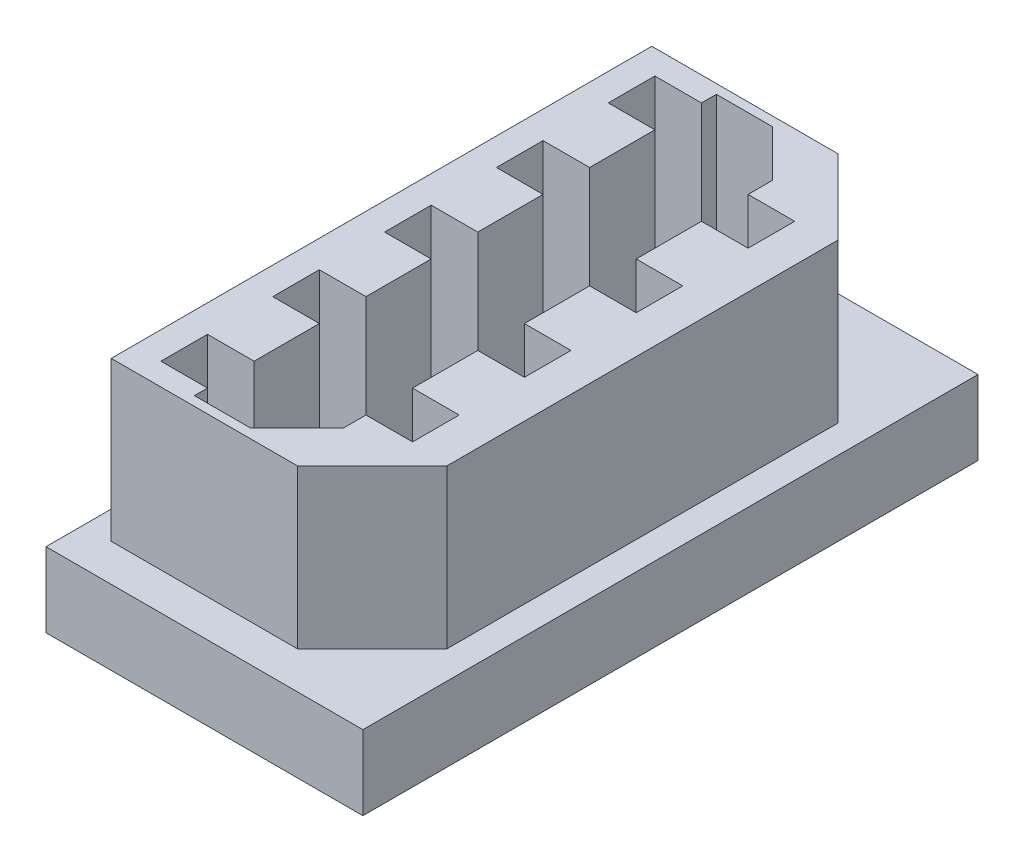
ISO-10303-21;
HEADER;
FILE_DESCRIPTION(('STEP AP214'),'2;1');
FILE_NAME('part.step','',(''),(''),'','','');
FILE_SCHEMA(('AUTOMOTIVE_DESIGN { 1 0 10303 214 1 1 1 1 }'));
ENDSEC;
DATA;
#1=APPLICATION_CONTEXT('core data for automotive mechanical design processes');
#2=APPLICATION_PROTOCOL_DEFINITION('international standard','automotive_design',2000,#1);
#3=PRODUCT_CONTEXT('',#1,'mechanical');
#4=PRODUCT('Part','Part','',(#3));
#5=PRODUCT_RELATED_PRODUCT_CATEGORY('part','',(#4));
#6=PRODUCT_DEFINITION_FORMATION('','',#4);
#7=PRODUCT_DEFINITION_CONTEXT('part definition',#1,'design');
#8=PRODUCT_DEFINITION('design','',#6,#7);
#9=PRODUCT_DEFINITION_SHAPE('','',#8);
#10=(LENGTH_UNIT() NAMED_UNIT(*) SI_UNIT(.MILLI.,.METRE.));
#11=(NAMED_UNIT(*) PLANE_ANGLE_UNIT() SI_UNIT($,.RADIAN.));
#12=(NAMED_UNIT(*) SI_UNIT($,.STERADIAN.) SOLID_ANGLE_UNIT());
#13=UNCERTAINTY_MEASURE_WITH_UNIT(LENGTH_MEASURE(1.E-05),#10,'distance_accuracy_value','');
#14=(GEOMETRIC_REPRESENTATION_CONTEXT(3) GLOBAL_UNCERTAINTY_ASSIGNED_CONTEXT((#13)) GLOBAL_UNIT_ASSIGNED_CONTEXT((#10,
#11,#12)) REPRESENTATION_CONTEXT('',''));
#15=CARTESIAN_POINT('',(0.,0.,0.));
#16=DIRECTION('',(0.,0.,1.));
#17=DIRECTION('',(1.,0.,0.));
#18=AXIS2_PLACEMENT_3D('',#15,#16,#17);
#19=CARTESIAN_POINT('',(23.4859743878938,2.49682,-11.06424));
#20=DIRECTION('',(-1.,0.,0.));
#21=DIRECTION('',(0.,0.,1.));
#22=AXIS2_PLACEMENT_3D('',#19,#20,#21);
#23=PLANE('',#22);
#24=DIRECTION('',(0.,1.,0.));
#25=VECTOR('',#24,1.);
#26=CARTESIAN_POINT('',(23.4859743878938,3.6195,-10.0838));
#27=LINE('',#26,#25);
#28=CARTESIAN_POINT('',(23.4859743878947,2.54,-10.0838));
#29=VERTEX_POINT('',#28);
#30=CARTESIAN_POINT('',(23.4859743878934,4.699,-10.0838));
#31=VERTEX_POINT('',#30);
#32=EDGE_CURVE('E719',#29,#31,#27,.T.);
#33=ORIENTED_EDGE('',*,*,#32,.T.);
#34=DIRECTION('',(0.,0.,-1.));
#35=VECTOR('',#34,1.);
#36=CARTESIAN_POINT('',(23.4859743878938,4.699,-7.366));
#37=LINE('',#36,#35);
#38=CARTESIAN_POINT('',(23.4859743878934,4.699,-9.1948));
#39=VERTEX_POINT('',#38);
#40=EDGE_CURVE('E737',#39,#31,#37,.T.);
#41=ORIENTED_EDGE('',*,*,#40,.F.);
#42=DIRECTION('',(0.,-1.,0.));
#43=VECTOR('',#42,1.);
#44=CARTESIAN_POINT('',(23.4859743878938,3.6195,-9.1948));
#45=LINE('',#44,#43);
#46=CARTESIAN_POINT('',(23.4859743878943,2.54,-9.1948));
#47=VERTEX_POINT('',#46);
#48=EDGE_CURVE('E730',#39,#47,#45,.T.);
#49=ORIENTED_EDGE('',*,*,#48,.T.);
#50=DIRECTION('',(0.,0.,1.));
#51=VECTOR('',#50,1.);
#52=CARTESIAN_POINT('',(23.4859743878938,2.54,-7.366));
#53=LINE('',#52,#51);
#54=EDGE_CURVE('E736',#29,#47,#53,.T.);
#55=ORIENTED_EDGE('',*,*,#54,.F.);
#56=EDGE_LOOP('',(#33,#41,#49,#55));
#57=FACE_BOUND('',#56,.T.);
#58=ADVANCED_FACE('F15',(#57),#23,.F.);
#59=CARTESIAN_POINT('',(23.4986743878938,2.49682,-9.1948));
#60=DIRECTION('',(0.,0.,-1.));
#61=DIRECTION('',(-1.,0.,0.));
#62=AXIS2_PLACEMENT_3D('',#59,#60,#61);
#63=PLANE('',#62);
#64=DIRECTION('',(-1.,0.,0.));
#65=VECTOR('',#64,1.);
#66=CARTESIAN_POINT('',(23.1684743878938,2.54,-9.1948));
#67=LINE('',#66,#65);
#68=CARTESIAN_POINT('',(22.8509743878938,2.54,-9.1948));
#69=VERTEX_POINT('',#68);
#70=EDGE_CURVE('E728',#47,#69,#67,.T.);
#71=ORIENTED_EDGE('',*,*,#70,.F.);
#72=ORIENTED_EDGE('',*,*,#48,.F.);
#73=DIRECTION('',(1.,0.,0.));
#74=VECTOR('',#73,1.);
#75=CARTESIAN_POINT('',(23.1684743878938,4.699,-9.1948));
#76=LINE('',#75,#74);
#77=CARTESIAN_POINT('',(22.8509743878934,4.699,-9.1948));
#78=VERTEX_POINT('',#77);
#79=EDGE_CURVE('E733',#78,#39,#76,.T.);
#80=ORIENTED_EDGE('',*,*,#79,.F.);
#81=DIRECTION('',(0.,-1.,0.));
#82=VECTOR('',#81,1.);
#83=CARTESIAN_POINT('',(22.8509743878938,3.6195,-9.1948));
#84=LINE('',#83,#82);
#85=EDGE_CURVE('E713',#78,#69,#84,.T.);
#86=ORIENTED_EDGE('',*,*,#85,.T.);
#87=EDGE_LOOP('',(#71,#72,#80,#86));
#88=FACE_BOUND('',#87,.T.);
#89=ADVANCED_FACE('F891',(#88),#63,.F.);
#90=CARTESIAN_POINT('',(22.8382743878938,2.49682,-10.0838));
#91=DIRECTION('',(0.,0.,1.));
#92=DIRECTION('',(1.,0.,0.));
#93=AXIS2_PLACEMENT_3D('',#90,#91,#92);
#94=PLANE('',#93);
#95=DIRECTION('',(1.,0.,0.));
#96=VECTOR('',#95,1.);
#97=CARTESIAN_POINT('',(23.1684743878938,2.54,-10.0838));
#98=LINE('',#97,#96);
#99=CARTESIAN_POINT('',(22.8509743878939,2.54,-10.0838));
#100=VERTEX_POINT('',#99);
#101=EDGE_CURVE('E722',#100,#29,#98,.T.);
#102=ORIENTED_EDGE('',*,*,#101,.F.);
#103=DIRECTION('',(0.,1.,0.));
#104=VECTOR('',#103,1.);
#105=CARTESIAN_POINT('',(22.8509743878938,3.6195,-10.0838));
#106=LINE('',#105,#104);
#107=CARTESIAN_POINT('',(22.8509743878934,4.699,-10.0838));
#108=VERTEX_POINT('',#107);
#109=EDGE_CURVE('E702',#100,#108,#106,.T.);
#110=ORIENTED_EDGE('',*,*,#109,.T.);
#111=DIRECTION('',(-1.,0.,0.));
#112=VECTOR('',#111,1.);
#113=CARTESIAN_POINT('',(23.1684743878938,4.699,-10.0838));
#114=LINE('',#113,#112);
#115=EDGE_CURVE('E725',#31,#108,#114,.T.);
#116=ORIENTED_EDGE('',*,*,#115,.F.);
#117=ORIENTED_EDGE('',*,*,#32,.F.);
#118=EDGE_LOOP('',(#102,#110,#116,#117));
#119=FACE_BOUND('',#118,.T.);
#120=ADVANCED_FACE('F743',(#119),#94,.F.);
#121=CARTESIAN_POINT('',(22.8509743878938,2.49682,-9.2075));
#122=DIRECTION('',(-1.,0.,0.));
#123=DIRECTION('',(0.,0.,1.));
#124=AXIS2_PLACEMENT_3D('',#121,#122,#123);
#125=PLANE('',#124);
#126=DIRECTION('',(0.,0.,1.));
#127=VECTOR('',#126,1.);
#128=CARTESIAN_POINT('',(22.8509743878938,2.54,-8.8773));
#129=LINE('',#128,#127);
#130=CARTESIAN_POINT('',(22.8509743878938,2.54,-8.5598));
#131=VERTEX_POINT('',#130);
#132=EDGE_CURVE('E711',#69,#131,#129,.T.);
#133=ORIENTED_EDGE('',*,*,#132,.F.);
#134=ORIENTED_EDGE('',*,*,#85,.F.);
#135=DIRECTION('',(0.,0.,-1.));
#136=VECTOR('',#135,1.);
#137=CARTESIAN_POINT('',(22.8509743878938,4.699,-8.8773));
#138=LINE('',#137,#136);
#139=CARTESIAN_POINT('',(22.8509743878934,4.699,-8.5598));
#140=VERTEX_POINT('',#139);
#141=EDGE_CURVE('E716',#140,#78,#138,.T.);
#142=ORIENTED_EDGE('',*,*,#141,.F.);
#143=DIRECTION('',(0.,-1.,0.));
#144=VECTOR('',#143,1.);
#145=CARTESIAN_POINT('',(22.8509743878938,3.6195,-8.5598));
#146=LINE('',#145,#144);
#147=EDGE_CURVE('E696',#140,#131,#146,.T.);
#148=ORIENTED_EDGE('',*,*,#147,.T.);
#149=EDGE_LOOP('',(#133,#134,#142,#148));
#150=FACE_BOUND('',#149,.T.);
#151=ADVANCED_FACE('F888',(#150),#125,.F.);
#152=CARTESIAN_POINT('',(22.8509743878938,2.49682,-10.7315));
#153=DIRECTION('',(-1.,0.,0.));
#154=DIRECTION('',(0.,0.,1.));
#155=AXIS2_PLACEMENT_3D('',#152,#153,#154);
#156=PLANE('',#155);
#157=DIRECTION('',(0.,0.,1.));
#158=VECTOR('',#157,1.);
#159=CARTESIAN_POINT('',(22.8509743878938,2.54,-10.4013));
#160=LINE('',#159,#158);
#161=CARTESIAN_POINT('',(22.8509743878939,2.54,-10.7188));
#162=VERTEX_POINT('',#161);
#163=EDGE_CURVE('E705',#162,#100,#160,.T.);
#164=ORIENTED_EDGE('',*,*,#163,.F.);
#165=DIRECTION('',(0.,1.,0.));
#166=VECTOR('',#165,1.);
#167=CARTESIAN_POINT('',(22.8509743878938,3.6195,-10.7188));
#168=LINE('',#167,#166);
#169=CARTESIAN_POINT('',(22.8509743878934,4.699,-10.7188));
#170=VERTEX_POINT('',#169);
#171=EDGE_CURVE('E686',#162,#170,#168,.T.);
#172=ORIENTED_EDGE('',*,*,#171,.T.);
#173=DIRECTION('',(0.,0.,-1.));
#174=VECTOR('',#173,1.);
#175=CARTESIAN_POINT('',(22.8509743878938,4.699,-10.4013));
#176=LINE('',#175,#174);
#177=EDGE_CURVE('E708',#108,#170,#176,.T.);
#178=ORIENTED_EDGE('',*,*,#177,.F.);
#179=ORIENTED_EDGE('',*,*,#109,.F.);
#180=EDGE_LOOP('',(#164,#172,#178,#179));
#181=FACE_BOUND('',#180,.T.);
#182=ADVANCED_FACE('F750',(#181),#156,.F.);
#183=CARTESIAN_POINT('',(22.8382743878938,2.49682,-8.5598));
#184=DIRECTION('',(0.,0.,1.));
#185=DIRECTION('',(1.,0.,0.));
#186=AXIS2_PLACEMENT_3D('',#183,#184,#185);
#187=PLANE('',#186);
#188=DIRECTION('',(1.,0.,0.));
#189=VECTOR('',#188,1.);
#190=CARTESIAN_POINT('',(23.1684743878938,2.54,-8.5598));
#191=LINE('',#190,#189);
#192=CARTESIAN_POINT('',(23.4859743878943,2.54,-8.5598));
#193=VERTEX_POINT('',#192);
#194=EDGE_CURVE('E694',#131,#193,#191,.T.);
#195=ORIENTED_EDGE('',*,*,#194,.F.);
#196=ORIENTED_EDGE('',*,*,#147,.F.);
#197=DIRECTION('',(-1.,0.,0.));
#198=VECTOR('',#197,1.);
#199=CARTESIAN_POINT('',(23.1684743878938,4.699,-8.5598));
#200=LINE('',#199,#198);
#201=CARTESIAN_POINT('',(23.4859743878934,4.699,-8.5598));
#202=VERTEX_POINT('',#201);
#203=EDGE_CURVE('E699',#202,#140,#200,.T.);
#204=ORIENTED_EDGE('',*,*,#203,.F.);
#205=DIRECTION('',(0.,-1.,0.));
#206=VECTOR('',#205,1.);
#207=CARTESIAN_POINT('',(23.4859743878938,3.6195,-8.5598));
#208=LINE('',#207,#206);
#209=EDGE_CURVE('E680',#202,#193,#208,.T.);
#210=ORIENTED_EDGE('',*,*,#209,.T.);
#211=EDGE_LOOP('',(#195,#196,#204,#210));
#212=FACE_BOUND('',#211,.T.);
#213=ADVANCED_FACE('F884',(#212),#187,.F.);
#214=CARTESIAN_POINT('',(23.4986743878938,2.49682,-10.7188));
#215=DIRECTION('',(0.,0.,-1.));
#216=DIRECTION('',(-1.,0.,0.));
#217=AXIS2_PLACEMENT_3D('',#214,#215,#216);
#218=PLANE('',#217);
#219=DIRECTION('',(-1.,0.,0.));
#220=VECTOR('',#219,1.);
#221=CARTESIAN_POINT('',(23.1684743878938,2.54,-10.7188));
#222=LINE('',#221,#220);
#223=CARTESIAN_POINT('',(23.4859743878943,2.54,-10.7188));
#224=VERTEX_POINT('',#223);
#225=EDGE_CURVE('E689',#224,#162,#222,.T.);
#226=ORIENTED_EDGE('',*,*,#225,.F.);
#227=DIRECTION('',(0.,1.,0.));
#228=VECTOR('',#227,1.);
#229=CARTESIAN_POINT('',(23.4859743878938,3.6195,-10.7188));
#230=LINE('',#229,#228);
#231=CARTESIAN_POINT('',(23.4859743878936,4.699,-10.7188));
#232=VERTEX_POINT('',#231);
#233=EDGE_CURVE('E675',#224,#232,#230,.T.);
#234=ORIENTED_EDGE('',*,*,#233,.T.);
#235=DIRECTION('',(1.,0.,0.));
#236=VECTOR('',#235,1.);
#237=CARTESIAN_POINT('',(23.1684743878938,4.699,-10.7188));
#238=LINE('',#237,#236);
#239=EDGE_CURVE('E692',#170,#232,#238,.T.);
#240=ORIENTED_EDGE('',*,*,#239,.F.);
#241=ORIENTED_EDGE('',*,*,#171,.F.);
#242=EDGE_LOOP('',(#226,#234,#240,#241));
#243=FACE_BOUND('',#242,.T.);
#244=ADVANCED_FACE('F752',(#243),#218,.F.);
#245=CARTESIAN_POINT('',(23.4859743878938,2.49682,-11.06424));
#246=DIRECTION('',(-1.,0.,0.));
#247=DIRECTION('',(0.,0.,1.));
#248=AXIS2_PLACEMENT_3D('',#245,#246,#247);
#249=PLANE('',#248);
#250=ORIENTED_EDGE('',*,*,#209,.F.);
#251=DIRECTION('',(0.,0.,-1.));
#252=VECTOR('',#251,1.);
#253=CARTESIAN_POINT('',(23.4859743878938,4.699,-7.366));
#254=LINE('',#253,#252);
#255=CARTESIAN_POINT('',(23.4859743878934,4.699,-7.6708));
#256=VERTEX_POINT('',#255);
#257=EDGE_CURVE('E683',#256,#202,#254,.T.);
#258=ORIENTED_EDGE('',*,*,#257,.F.);
#259=DIRECTION('',(0.,-1.,0.));
#260=VECTOR('',#259,1.);
#261=CARTESIAN_POINT('',(23.4859743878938,3.6195,-7.6708));
#262=LINE('',#261,#260);
#263=CARTESIAN_POINT('',(23.4859743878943,2.54,-7.6708));
#264=VERTEX_POINT('',#263);
#265=EDGE_CURVE('E663',#256,#264,#262,.T.);
#266=ORIENTED_EDGE('',*,*,#265,.T.);
#267=DIRECTION('',(0.,0.,1.));
#268=VECTOR('',#267,1.);
#269=CARTESIAN_POINT('',(23.4859743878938,2.54,-7.366));
#270=LINE('',#269,#268);
#271=EDGE_CURVE('E678',#193,#264,#270,.T.);
#272=ORIENTED_EDGE('',*,*,#271,.F.);
#273=EDGE_LOOP('',(#250,#258,#266,#272));
#274=FACE_BOUND('',#273,.T.);
#275=ADVANCED_FACE('F880',(#274),#249,.F.);
#276=CARTESIAN_POINT('',(23.4859743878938,2.49682,-11.06424));
#277=DIRECTION('',(-1.,0.,0.));
#278=DIRECTION('',(0.,0.,1.));
#279=AXIS2_PLACEMENT_3D('',#276,#277,#278);
#280=PLANE('',#279);
#281=DIRECTION('',(0.,1.,0.));
#282=VECTOR('',#281,1.);
#283=CARTESIAN_POINT('',(23.4859743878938,3.6195,-10.922));
#284=LINE('',#283,#282);
#285=CARTESIAN_POINT('',(23.4859743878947,2.54,-10.922));
#286=VERTEX_POINT('',#285);
#287=CARTESIAN_POINT('',(23.4859743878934,4.699,-10.922));
#288=VERTEX_POINT('',#287);
#289=EDGE_CURVE('E652',#286,#288,#284,.T.);
#290=ORIENTED_EDGE('',*,*,#289,.T.);
#291=DIRECTION('',(0.,0.,-1.));
#292=VECTOR('',#291,1.);
#293=CARTESIAN_POINT('',(23.4859743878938,4.699,-7.366));
#294=LINE('',#293,#292);
#295=EDGE_CURVE('E672',#232,#288,#294,.T.);
#296=ORIENTED_EDGE('',*,*,#295,.F.);
#297=ORIENTED_EDGE('',*,*,#233,.F.);
#298=DIRECTION('',(0.,0.,1.));
#299=VECTOR('',#298,1.);
#300=CARTESIAN_POINT('',(23.4859743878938,2.54,-7.366));
#301=LINE('',#300,#299);
#302=EDGE_CURVE('E669',#286,#224,#301,.T.);
#303=ORIENTED_EDGE('',*,*,#302,.F.);
#304=EDGE_LOOP('',(#290,#296,#297,#303));
#305=FACE_BOUND('',#304,.T.);
#306=ADVANCED_FACE('F756',(#305),#280,.F.);
#307=CARTESIAN_POINT('',(23.4986743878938,2.49682,-7.6708));
#308=DIRECTION('',(0.,0.,-1.));
#309=DIRECTION('',(-1.,0.,0.));
#310=AXIS2_PLACEMENT_3D('',#307,#308,#309);
#311=PLANE('',#310);
#312=DIRECTION('',(-1.,0.,0.));
#313=VECTOR('',#312,1.);
#314=CARTESIAN_POINT('',(23.1684743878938,2.54,-7.6708));
#315=LINE('',#314,#313);
#316=CARTESIAN_POINT('',(22.8509743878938,2.54,-7.6708));
#317=VERTEX_POINT('',#316);
#318=EDGE_CURVE('E661',#264,#317,#315,.T.);
#319=ORIENTED_EDGE('',*,*,#318,.F.);
#320=ORIENTED_EDGE('',*,*,#265,.F.);
#321=DIRECTION('',(1.,0.,0.));
#322=VECTOR('',#321,1.);
#323=CARTESIAN_POINT('',(23.1684743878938,4.699,-7.6708));
#324=LINE('',#323,#322);
#325=CARTESIAN_POINT('',(22.8509743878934,4.699,-7.6708));
#326=VERTEX_POINT('',#325);
#327=EDGE_CURVE('E666',#326,#256,#324,.T.);
#328=ORIENTED_EDGE('',*,*,#327,.F.);
#329=DIRECTION('',(0.,-1.,0.));
#330=VECTOR('',#329,1.);
#331=CARTESIAN_POINT('',(22.8509743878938,3.6195,-7.6708));
#332=LINE('',#331,#330);
#333=EDGE_CURVE('E646',#326,#317,#332,.T.);
#334=ORIENTED_EDGE('',*,*,#333,.T.);
#335=EDGE_LOOP('',(#319,#320,#328,#334));
#336=FACE_BOUND('',#335,.T.);
#337=ADVANCED_FACE('F876',(#336),#311,.F.);
#338=CARTESIAN_POINT('',(24.2632143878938,2.49682,-10.922));
#339=DIRECTION('',(0.,0.,-1.));
#340=DIRECTION('',(-1.,0.,0.));
#341=AXIS2_PLACEMENT_3D('',#338,#339,#340);
#342=PLANE('',#341);
#343=DIRECTION('',(-1.,0.,0.));
#344=VECTOR('',#343,1.);
#345=CARTESIAN_POINT('',(23.8669743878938,2.54,-10.922));
#346=LINE('',#345,#344);
#347=CARTESIAN_POINT('',(24.2479743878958,2.54,-10.922));
#348=VERTEX_POINT('',#347);
#349=EDGE_CURVE('E655',#348,#286,#346,.T.);
#350=ORIENTED_EDGE('',*,*,#349,.F.);
#351=DIRECTION('',(0.,1.,0.));
#352=VECTOR('',#351,1.);
#353=CARTESIAN_POINT('',(24.2479743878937,3.6195,-10.9220000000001));
#354=LINE('',#353,#352);
#355=CARTESIAN_POINT('',(24.2479743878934,4.699,-10.922));
#356=VERTEX_POINT('',#355);
#357=EDGE_CURVE('E636',#348,#356,#354,.T.);
#358=ORIENTED_EDGE('',*,*,#357,.T.);
#359=DIRECTION('',(1.,0.,0.));
#360=VECTOR('',#359,1.);
#361=CARTESIAN_POINT('',(23.8669743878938,4.699,-10.922));
#362=LINE('',#361,#360);
#363=EDGE_CURVE('E658',#288,#356,#362,.T.);
#364=ORIENTED_EDGE('',*,*,#363,.F.);
#365=ORIENTED_EDGE('',*,*,#289,.F.);
#366=EDGE_LOOP('',(#350,#358,#364,#365));
#367=FACE_BOUND('',#366,.T.);
#368=ADVANCED_FACE('F759',(#367),#342,.F.);
#369=CARTESIAN_POINT('',(22.8509743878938,2.49682,-7.6835));
#370=DIRECTION('',(-1.,0.,0.));
#371=DIRECTION('',(0.,0.,1.));
#372=AXIS2_PLACEMENT_3D('',#369,#370,#371);
#373=PLANE('',#372);
#374=DIRECTION('',(0.,0.,1.));
#375=VECTOR('',#374,1.);
#376=CARTESIAN_POINT('',(22.8509743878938,2.54,-7.3533));
#377=LINE('',#376,#375);
#378=CARTESIAN_POINT('',(22.8509743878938,2.54,-7.0358));
#379=VERTEX_POINT('',#378);
#380=EDGE_CURVE('E644',#317,#379,#377,.T.);
#381=ORIENTED_EDGE('',*,*,#380,.F.);
#382=ORIENTED_EDGE('',*,*,#333,.F.);
#383=DIRECTION('',(0.,0.,-1.));
#384=VECTOR('',#383,1.);
#385=CARTESIAN_POINT('',(22.8509743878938,4.699,-7.3533));
#386=LINE('',#385,#384);
#387=CARTESIAN_POINT('',(22.8509743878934,4.699,-7.0358));
#388=VERTEX_POINT('',#387);
#389=EDGE_CURVE('E649',#388,#326,#386,.T.);
#390=ORIENTED_EDGE('',*,*,#389,.F.);
#391=DIRECTION('',(0.,-1.,0.));
#392=VECTOR('',#391,1.);
#393=CARTESIAN_POINT('',(22.8509743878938,3.6195,-7.0358));
#394=LINE('',#393,#392);
#395=EDGE_CURVE('E630',#388,#379,#394,.T.);
#396=ORIENTED_EDGE('',*,*,#395,.T.);
#397=EDGE_LOOP('',(#381,#382,#390,#396));
#398=FACE_BOUND('',#397,.T.);
#399=ADVANCED_FACE('F872',(#398),#373,.F.);
#400=CARTESIAN_POINT('',(24.8956743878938,2.49682,-10.2743));
#401=DIRECTION('',(0.707106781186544,0.,-0.707106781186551));
#402=DIRECTION('',(-0.707106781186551,0.,-0.707106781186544));
#403=AXIS2_PLACEMENT_3D('',#400,#401,#402);
#404=PLANE('',#403);
#405=DIRECTION('',(-0.707106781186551,0.,-0.707106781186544));
#406=VECTOR('',#405,1.);
#407=CARTESIAN_POINT('',(24.5654743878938,2.54,-10.6045));
#408=LINE('',#407,#406);
#409=CARTESIAN_POINT('',(24.8829743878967,2.54,-10.287));
#410=VERTEX_POINT('',#409);
#411=EDGE_CURVE('E639',#410,#348,#408,.T.);
#412=ORIENTED_EDGE('',*,*,#411,.F.);
#413=DIRECTION('',(0.,1.,0.));
#414=VECTOR('',#413,1.);
#415=CARTESIAN_POINT('',(24.8829743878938,3.6195,-10.287));
#416=LINE('',#415,#414);
#417=CARTESIAN_POINT('',(24.8829743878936,4.699,-10.287));
#418=VERTEX_POINT('',#417);
#419=EDGE_CURVE('E622',#410,#418,#416,.T.);
#420=ORIENTED_EDGE('',*,*,#419,.T.);
#421=DIRECTION('',(0.707106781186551,0.,0.707106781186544));
#422=VECTOR('',#421,1.);
#423=CARTESIAN_POINT('',(24.5654743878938,4.699,-10.6045));
#424=LINE('',#423,#422);
#425=EDGE_CURVE('E642',#356,#418,#424,.T.);
#426=ORIENTED_EDGE('',*,*,#425,.F.);
#427=ORIENTED_EDGE('',*,*,#357,.F.);
#428=EDGE_LOOP('',(#412,#420,#426,#427));
#429=FACE_BOUND('',#428,.T.);
#430=ADVANCED_FACE('F763',(#429),#404,.F.);
#431=CARTESIAN_POINT('',(22.8382743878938,2.49682,-7.0358));
#432=DIRECTION('',(0.,0.,1.));
#433=DIRECTION('',(1.,0.,0.));
#434=AXIS2_PLACEMENT_3D('',#431,#432,#433);
#435=PLANE('',#434);
#436=DIRECTION('',(1.,0.,0.));
#437=VECTOR('',#436,1.);
#438=CARTESIAN_POINT('',(23.1684743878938,2.54,-7.0358));
#439=LINE('',#438,#437);
#440=CARTESIAN_POINT('',(23.4859743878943,2.54,-7.0358));
#441=VERTEX_POINT('',#440);
#442=EDGE_CURVE('E628',#379,#441,#439,.T.);
#443=ORIENTED_EDGE('',*,*,#442,.F.);
#444=ORIENTED_EDGE('',*,*,#395,.F.);
#445=DIRECTION('',(-1.,0.,0.));
#446=VECTOR('',#445,1.);
#447=CARTESIAN_POINT('',(23.1684743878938,4.699,-7.0358));
#448=LINE('',#447,#446);
#449=CARTESIAN_POINT('',(23.4859743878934,4.699,-7.0358));
#450=VERTEX_POINT('',#449);
#451=EDGE_CURVE('E633',#450,#388,#448,.T.);
#452=ORIENTED_EDGE('',*,*,#451,.F.);
#453=DIRECTION('',(0.,-1.,0.));
#454=VECTOR('',#453,1.);
#455=CARTESIAN_POINT('',(23.4859743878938,3.6195,-7.0358));
#456=LINE('',#455,#454);
#457=EDGE_CURVE('E613',#450,#441,#456,.T.);
#458=ORIENTED_EDGE('',*,*,#457,.T.);
#459=EDGE_LOOP('',(#443,#444,#452,#458));
#460=FACE_BOUND('',#459,.T.);
#461=ADVANCED_FACE('F869',(#460),#435,.F.);
#462=CARTESIAN_POINT('',(24.8829743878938,2.49682,-4.32816));
#463=DIRECTION('',(1.,0.,0.));
#464=DIRECTION('',(0.,0.,-1.));
#465=AXIS2_PLACEMENT_3D('',#462,#463,#464);
#466=PLANE('',#465);
#467=ORIENTED_EDGE('',*,*,#419,.F.);
#468=DIRECTION('',(0.,0.,-1.));
#469=VECTOR('',#468,1.);
#470=CARTESIAN_POINT('',(24.8829743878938,2.54,-7.366));
#471=LINE('',#470,#469);
#472=CARTESIAN_POINT('',(24.8829743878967,2.54,-9.9568));
#473=VERTEX_POINT('',#472);
#474=EDGE_CURVE('E625',#473,#410,#471,.T.);
#475=ORIENTED_EDGE('',*,*,#474,.F.);
#476=DIRECTION('',(0.,1.,0.));
#477=VECTOR('',#476,1.);
#478=CARTESIAN_POINT('',(24.8829743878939,3.6195,-9.9568));
#479=LINE('',#478,#477);
#480=CARTESIAN_POINT('',(24.8829743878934,4.699,-9.9568));
#481=VERTEX_POINT('',#480);
#482=EDGE_CURVE('E602',#473,#481,#479,.T.);
#483=ORIENTED_EDGE('',*,*,#482,.T.);
#484=DIRECTION('',(0.,0.,1.));
#485=VECTOR('',#484,1.);
#486=CARTESIAN_POINT('',(24.8829743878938,4.699,-7.366));
#487=LINE('',#486,#485);
#488=EDGE_CURVE('E619',#418,#481,#487,.T.);
#489=ORIENTED_EDGE('',*,*,#488,.F.);
#490=EDGE_LOOP('',(#467,#475,#483,#489));
#491=FACE_BOUND('',#490,.T.);
#492=ADVANCED_FACE('F766',(#491),#466,.F.);
#493=CARTESIAN_POINT('',(23.4859743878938,2.49682,-11.06424));
#494=DIRECTION('',(-1.,0.,0.));
#495=DIRECTION('',(0.,0.,1.));
#496=AXIS2_PLACEMENT_3D('',#493,#494,#495);
#497=PLANE('',#496);
#498=ORIENTED_EDGE('',*,*,#457,.F.);
#499=DIRECTION('',(0.,0.,-1.));
#500=VECTOR('',#499,1.);
#501=CARTESIAN_POINT('',(23.4859743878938,4.699,-7.366));
#502=LINE('',#501,#500);
#503=CARTESIAN_POINT('',(23.4859743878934,4.699,-6.1468));
#504=VERTEX_POINT('',#503);
#505=EDGE_CURVE('E616',#504,#450,#502,.T.);
#506=ORIENTED_EDGE('',*,*,#505,.F.);
#507=DIRECTION('',(0.,-1.,0.));
#508=VECTOR('',#507,1.);
#509=CARTESIAN_POINT('',(23.4859743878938,3.6195,-6.1468));
#510=LINE('',#509,#508);
#511=CARTESIAN_POINT('',(23.4859743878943,2.54,-6.1468));
#512=VERTEX_POINT('',#511);
#513=EDGE_CURVE('E596',#504,#512,#510,.T.);
#514=ORIENTED_EDGE('',*,*,#513,.T.);
#515=DIRECTION('',(0.,0.,1.));
#516=VECTOR('',#515,1.);
#517=CARTESIAN_POINT('',(23.4859743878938,2.54,-7.366));
#518=LINE('',#517,#516);
#519=EDGE_CURVE('E611',#441,#512,#518,.T.);
#520=ORIENTED_EDGE('',*,*,#519,.F.);
#521=EDGE_LOOP('',(#498,#506,#514,#520));
#522=FACE_BOUND('',#521,.T.);
#523=ADVANCED_FACE('F865',(#522),#497,.F.);
#524=CARTESIAN_POINT('',(25.5306743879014,2.49682,-9.9568));
#525=DIRECTION('',(0.,0.,-1.));
#526=DIRECTION('',(-1.,0.,0.));
#527=AXIS2_PLACEMENT_3D('',#524,#525,#526);
#528=PLANE('',#527);
#529=DIRECTION('',(-1.,0.,0.));
#530=VECTOR('',#529,1.);
#531=CARTESIAN_POINT('',(25.2004743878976,2.54,-9.9568));
#532=LINE('',#531,#530);
#533=CARTESIAN_POINT('',(25.5179743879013,2.54,-9.9568));
#534=VERTEX_POINT('',#533);
#535=EDGE_CURVE('E605',#534,#473,#532,.T.);
#536=ORIENTED_EDGE('',*,*,#535,.F.);
#537=DIRECTION('',(0.,1.,0.));
#538=VECTOR('',#537,1.);
#539=CARTESIAN_POINT('',(25.5179743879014,3.6195,-9.9568));
#540=LINE('',#539,#538);
#541=CARTESIAN_POINT('',(25.5179743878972,4.699,-9.9568));
#542=VERTEX_POINT('',#541);
#543=EDGE_CURVE('E585',#534,#542,#540,.T.);
#544=ORIENTED_EDGE('',*,*,#543,.T.);
#545=DIRECTION('',(1.,0.,0.));
#546=VECTOR('',#545,1.);
#547=CARTESIAN_POINT('',(25.2004743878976,4.699,-9.9568));
#548=LINE('',#547,#546);
#549=EDGE_CURVE('E608',#481,#542,#548,.T.);
#550=ORIENTED_EDGE('',*,*,#549,.F.);
#551=ORIENTED_EDGE('',*,*,#482,.F.);
#552=EDGE_LOOP('',(#536,#544,#550,#551));
#553=FACE_BOUND('',#552,.T.);
#554=ADVANCED_FACE('F770',(#553),#528,.F.);
#555=CARTESIAN_POINT('',(23.4986743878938,2.49682,-6.1468));
#556=DIRECTION('',(0.,0.,-1.));
#557=DIRECTION('',(-1.,0.,0.));
#558=AXIS2_PLACEMENT_3D('',#555,#556,#557);
#559=PLANE('',#558);
#560=DIRECTION('',(-1.,0.,0.));
#561=VECTOR('',#560,1.);
#562=CARTESIAN_POINT('',(23.1684743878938,2.54,-6.1468));
#563=LINE('',#562,#561);
#564=CARTESIAN_POINT('',(22.8509743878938,2.54,-6.1468));
#565=VERTEX_POINT('',#564);
#566=EDGE_CURVE('E594',#512,#565,#563,.T.);
#567=ORIENTED_EDGE('',*,*,#566,.F.);
#568=ORIENTED_EDGE('',*,*,#513,.F.);
#569=DIRECTION('',(1.,0.,0.));
#570=VECTOR('',#569,1.);
#571=CARTESIAN_POINT('',(23.1684743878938,4.699,-6.1468));
#572=LINE('',#571,#570);
#573=CARTESIAN_POINT('',(22.8509743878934,4.699,-6.1468));
#574=VERTEX_POINT('',#573);
#575=EDGE_CURVE('E599',#574,#504,#572,.T.);
#576=ORIENTED_EDGE('',*,*,#575,.F.);
#577=DIRECTION('',(0.,-1.,0.));
#578=VECTOR('',#577,1.);
#579=CARTESIAN_POINT('',(22.8509743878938,3.6195,-6.1468));
#580=LINE('',#579,#578);
#581=EDGE_CURVE('E579',#574,#565,#580,.T.);
#582=ORIENTED_EDGE('',*,*,#581,.T.);
#583=EDGE_LOOP('',(#567,#568,#576,#582));
#584=FACE_BOUND('',#583,.T.);
#585=ADVANCED_FACE('F860',(#584),#559,.F.);
#586=CARTESIAN_POINT('',(25.5179743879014,2.49682,-9.3091));
#587=DIRECTION('',(1.,0.,0.));
#588=DIRECTION('',(0.,0.,-1.));
#589=AXIS2_PLACEMENT_3D('',#586,#587,#588);
#590=PLANE('',#589);
#591=DIRECTION('',(0.,0.,-1.));
#592=VECTOR('',#591,1.);
#593=CARTESIAN_POINT('',(25.5179743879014,2.54,-9.6393));
#594=LINE('',#593,#592);
#595=CARTESIAN_POINT('',(25.5179743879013,2.54,-9.3218));
#596=VERTEX_POINT('',#595);
#597=EDGE_CURVE('E588',#596,#534,#594,.T.);
#598=ORIENTED_EDGE('',*,*,#597,.F.);
#599=DIRECTION('',(0.,1.,0.));
#600=VECTOR('',#599,1.);
#601=CARTESIAN_POINT('',(25.5179743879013,3.6195,-9.3218));
#602=LINE('',#601,#600);
#603=CARTESIAN_POINT('',(25.5179743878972,4.699,-9.3218));
#604=VERTEX_POINT('',#603);
#605=EDGE_CURVE('E569',#596,#604,#602,.T.);
#606=ORIENTED_EDGE('',*,*,#605,.T.);
#607=DIRECTION('',(0.,0.,1.));
#608=VECTOR('',#607,1.);
#609=CARTESIAN_POINT('',(25.5179743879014,4.699,-9.6393));
#610=LINE('',#609,#608);
#611=EDGE_CURVE('E591',#542,#604,#610,.T.);
#612=ORIENTED_EDGE('',*,*,#611,.F.);
#613=ORIENTED_EDGE('',*,*,#543,.F.);
#614=EDGE_LOOP('',(#598,#606,#612,#613));
#615=FACE_BOUND('',#614,.T.);
#616=ADVANCED_FACE('F772',(#615),#590,.F.);
#617=CARTESIAN_POINT('',(22.8509743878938,2.49682,-6.1595));
#618=DIRECTION('',(-1.,0.,0.));
#619=DIRECTION('',(0.,0.,1.));
#620=AXIS2_PLACEMENT_3D('',#617,#618,#619);
#621=PLANE('',#620);
#622=DIRECTION('',(0.,0.,1.));
#623=VECTOR('',#622,1.);
#624=CARTESIAN_POINT('',(22.8509743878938,2.54,-5.8293));
#625=LINE('',#624,#623);
#626=CARTESIAN_POINT('',(22.8509743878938,2.54,-5.5118));
#627=VERTEX_POINT('',#626);
#628=EDGE_CURVE('E577',#565,#627,#625,.T.);
#629=ORIENTED_EDGE('',*,*,#628,.F.);
#630=ORIENTED_EDGE('',*,*,#581,.F.);
#631=DIRECTION('',(0.,0.,-1.));
#632=VECTOR('',#631,1.);
#633=CARTESIAN_POINT('',(22.8509743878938,4.699,-5.8293));
#634=LINE('',#633,#632);
#635=CARTESIAN_POINT('',(22.8509743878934,4.699,-5.5118));
#636=VERTEX_POINT('',#635);
#637=EDGE_CURVE('E582',#636,#574,#634,.T.);
#638=ORIENTED_EDGE('',*,*,#637,.F.);
#639=DIRECTION('',(0.,-1.,0.));
#640=VECTOR('',#639,1.);
#641=CARTESIAN_POINT('',(22.8509743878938,3.6195,-5.5118));
#642=LINE('',#641,#640);
#643=EDGE_CURVE('E563',#636,#627,#642,.T.);
#644=ORIENTED_EDGE('',*,*,#643,.T.);
#645=EDGE_LOOP('',(#629,#630,#638,#644));
#646=FACE_BOUND('',#645,.T.);
#647=ADVANCED_FACE('F857',(#646),#621,.F.);
#648=CARTESIAN_POINT('',(24.8702743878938,2.49682,-9.3218));
#649=DIRECTION('',(0.,0.,1.));
#650=DIRECTION('',(1.,0.,0.));
#651=AXIS2_PLACEMENT_3D('',#648,#649,#650);
#652=PLANE('',#651);
#653=DIRECTION('',(1.,0.,0.));
#654=VECTOR('',#653,1.);
#655=CARTESIAN_POINT('',(25.2004743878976,2.54,-9.3218));
#656=LINE('',#655,#654);
#657=CARTESIAN_POINT('',(24.8829743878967,2.54,-9.3218));
#658=VERTEX_POINT('',#657);
#659=EDGE_CURVE('E572',#658,#596,#656,.T.);
#660=ORIENTED_EDGE('',*,*,#659,.F.);
#661=DIRECTION('',(0.,1.,0.));
#662=VECTOR('',#661,1.);
#663=CARTESIAN_POINT('',(24.8829743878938,3.6195,-9.3218));
#664=LINE('',#663,#662);
#665=CARTESIAN_POINT('',(24.8829743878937,4.699,-9.3218));
#666=VERTEX_POINT('',#665);
#667=EDGE_CURVE('E555',#658,#666,#664,.T.);
#668=ORIENTED_EDGE('',*,*,#667,.T.);
#669=DIRECTION('',(-1.,0.,0.));
#670=VECTOR('',#669,1.);
#671=CARTESIAN_POINT('',(25.2004743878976,4.699,-9.3218));
#672=LINE('',#671,#670);
#673=EDGE_CURVE('E575',#604,#666,#672,.T.);
#674=ORIENTED_EDGE('',*,*,#673,.F.);
#675=ORIENTED_EDGE('',*,*,#605,.F.);
#676=EDGE_LOOP('',(#660,#668,#674,#675));
#677=FACE_BOUND('',#676,.T.);
#678=ADVANCED_FACE('F776',(#677),#652,.F.);
#679=CARTESIAN_POINT('',(22.8382743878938,2.49682,-5.5118));
#680=DIRECTION('',(0.,0.,1.));
#681=DIRECTION('',(1.,0.,0.));
#682=AXIS2_PLACEMENT_3D('',#679,#680,#681);
#683=PLANE('',#682);
#684=DIRECTION('',(1.,0.,0.));
#685=VECTOR('',#684,1.);
#686=CARTESIAN_POINT('',(23.1684743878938,2.54,-5.5118));
#687=LINE('',#686,#685);
#688=CARTESIAN_POINT('',(23.4859743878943,2.54,-5.5118));
#689=VERTEX_POINT('',#688);
#690=EDGE_CURVE('E561',#627,#689,#687,.T.);
#691=ORIENTED_EDGE('',*,*,#690,.F.);
#692=ORIENTED_EDGE('',*,*,#643,.F.);
#693=DIRECTION('',(-1.,0.,0.));
#694=VECTOR('',#693,1.);
#695=CARTESIAN_POINT('',(23.1684743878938,4.699,-5.5118));
#696=LINE('',#695,#694);
#697=CARTESIAN_POINT('',(23.4859743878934,4.699,-5.5118));
#698=VERTEX_POINT('',#697);
#699=EDGE_CURVE('E566',#698,#636,#696,.T.);
#700=ORIENTED_EDGE('',*,*,#699,.F.);
#701=DIRECTION('',(0.,-1.,0.));
#702=VECTOR('',#701,1.);
#703=CARTESIAN_POINT('',(23.4859743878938,3.6195,-5.5118));
#704=LINE('',#703,#702);
#705=EDGE_CURVE('E546',#698,#689,#704,.T.);
#706=ORIENTED_EDGE('',*,*,#705,.T.);
#707=EDGE_LOOP('',(#691,#692,#700,#706));
#708=FACE_BOUND('',#707,.T.);
#709=ADVANCED_FACE('F852',(#708),#683,.F.);
#710=CARTESIAN_POINT('',(24.8829743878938,2.49682,-4.32816));
#711=DIRECTION('',(1.,0.,0.));
#712=DIRECTION('',(0.,0.,-1.));
#713=AXIS2_PLACEMENT_3D('',#710,#711,#712);
#714=PLANE('',#713);
#715=ORIENTED_EDGE('',*,*,#667,.F.);
#716=DIRECTION('',(0.,0.,-1.));
#717=VECTOR('',#716,1.);
#718=CARTESIAN_POINT('',(24.8829743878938,2.54,-7.366));
#719=LINE('',#718,#717);
#720=CARTESIAN_POINT('',(24.8829743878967,2.54,-8.4328));
#721=VERTEX_POINT('',#720);
#722=EDGE_CURVE('E558',#721,#658,#719,.T.);
#723=ORIENTED_EDGE('',*,*,#722,.F.);
#724=DIRECTION('',(0.,1.,0.));
#725=VECTOR('',#724,1.);
#726=CARTESIAN_POINT('',(24.8829743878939,3.6195,-8.4328));
#727=LINE('',#726,#725);
#728=CARTESIAN_POINT('',(24.8829743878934,4.699,-8.4328));
#729=VERTEX_POINT('',#728);
#730=EDGE_CURVE('E535',#721,#729,#727,.T.);
#731=ORIENTED_EDGE('',*,*,#730,.T.);
#732=DIRECTION('',(0.,0.,1.));
#733=VECTOR('',#732,1.);
#734=CARTESIAN_POINT('',(24.8829743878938,4.699,-7.366));
#735=LINE('',#734,#733);
#736=EDGE_CURVE('E552',#666,#729,#735,.T.);
#737=ORIENTED_EDGE('',*,*,#736,.F.);
#738=EDGE_LOOP('',(#715,#723,#731,#737));
#739=FACE_BOUND('',#738,.T.);
#740=ADVANCED_FACE('F779',(#739),#714,.F.);
#741=CARTESIAN_POINT('',(23.4859743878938,2.49682,-11.06424));
#742=DIRECTION('',(-1.,0.,0.));
#743=DIRECTION('',(0.,0.,1.));
#744=AXIS2_PLACEMENT_3D('',#741,#742,#743);
#745=PLANE('',#744);
#746=ORIENTED_EDGE('',*,*,#705,.F.);
#747=DIRECTION('',(0.,0.,-1.));
#748=VECTOR('',#747,1.);
#749=CARTESIAN_POINT('',(23.4859743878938,4.699,-7.366));
#750=LINE('',#749,#748);
#751=CARTESIAN_POINT('',(23.4859743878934,4.699,-4.6228));
#752=VERTEX_POINT('',#751);
#753=EDGE_CURVE('E549',#752,#698,#750,.T.);
#754=ORIENTED_EDGE('',*,*,#753,.F.);
#755=DIRECTION('',(0.,-1.,0.));
#756=VECTOR('',#755,1.);
#757=CARTESIAN_POINT('',(23.4859743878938,3.6195,-4.6228));
#758=LINE('',#757,#756);
#759=CARTESIAN_POINT('',(23.4859743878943,2.54,-4.6228));
#760=VERTEX_POINT('',#759);
#761=EDGE_CURVE('E529',#752,#760,#758,.T.);
#762=ORIENTED_EDGE('',*,*,#761,.T.);
#763=DIRECTION('',(0.,0.,1.));
#764=VECTOR('',#763,1.);
#765=CARTESIAN_POINT('',(23.4859743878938,2.54,-7.366));
#766=LINE('',#765,#764);
#767=EDGE_CURVE('E544',#689,#760,#766,.T.);
#768=ORIENTED_EDGE('',*,*,#767,.F.);
#769=EDGE_LOOP('',(#746,#754,#762,#768));
#770=FACE_BOUND('',#769,.T.);
#771=ADVANCED_FACE('F849',(#770),#745,.F.);
#772=CARTESIAN_POINT('',(25.5306743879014,2.49682,-8.4328));
#773=DIRECTION('',(0.,0.,-1.));
#774=DIRECTION('',(-1.,0.,0.));
#775=AXIS2_PLACEMENT_3D('',#772,#773,#774);
#776=PLANE('',#775);
#777=DIRECTION('',(-1.,0.,0.));
#778=VECTOR('',#777,1.);
#779=CARTESIAN_POINT('',(25.2004743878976,2.54,-8.4328));
#780=LINE('',#779,#778);
#781=CARTESIAN_POINT('',(25.5179743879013,2.54,-8.4328));
#782=VERTEX_POINT('',#781);
#783=EDGE_CURVE('E538',#782,#721,#780,.T.);
#784=ORIENTED_EDGE('',*,*,#783,.F.);
#785=DIRECTION('',(0.,1.,0.));
#786=VECTOR('',#785,1.);
#787=CARTESIAN_POINT('',(25.5179743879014,3.6195,-8.4328));
#788=LINE('',#787,#786);
#789=CARTESIAN_POINT('',(25.5179743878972,4.699,-8.4328));
#790=VERTEX_POINT('',#789);
#791=EDGE_CURVE('E518',#782,#790,#788,.T.);
#792=ORIENTED_EDGE('',*,*,#791,.T.);
#793=DIRECTION('',(1.,0.,0.));
#794=VECTOR('',#793,1.);
#795=CARTESIAN_POINT('',(25.2004743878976,4.699,-8.4328));
#796=LINE('',#795,#794);
#797=EDGE_CURVE('E541',#729,#790,#796,.T.);
#798=ORIENTED_EDGE('',*,*,#797,.F.);
#799=ORIENTED_EDGE('',*,*,#730,.F.);
#800=EDGE_LOOP('',(#784,#792,#798,#799));
#801=FACE_BOUND('',#800,.T.);
#802=ADVANCED_FACE('F783',(#801),#776,.F.);
#803=CARTESIAN_POINT('',(23.4986743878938,2.49682,-4.6228));
#804=DIRECTION('',(0.,0.,-1.));
#805=DIRECTION('',(-1.,0.,0.));
#806=AXIS2_PLACEMENT_3D('',#803,#804,#805);
#807=PLANE('',#806);
#808=DIRECTION('',(-1.,0.,0.));
#809=VECTOR('',#808,1.);
#810=CARTESIAN_POINT('',(23.1684743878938,2.54,-4.6228));
#811=LINE('',#810,#809);
#812=CARTESIAN_POINT('',(22.8509743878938,2.54,-4.6228));
#813=VERTEX_POINT('',#812);
#814=EDGE_CURVE('E527',#760,#813,#811,.T.);
#815=ORIENTED_EDGE('',*,*,#814,.F.);
#816=ORIENTED_EDGE('',*,*,#761,.F.);
#817=DIRECTION('',(1.,0.,0.));
#818=VECTOR('',#817,1.);
#819=CARTESIAN_POINT('',(23.1684743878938,4.699,-4.6228));
#820=LINE('',#819,#818);
#821=CARTESIAN_POINT('',(22.8509743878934,4.699,-4.6228));
#822=VERTEX_POINT('',#821);
#823=EDGE_CURVE('E532',#822,#752,#820,.T.);
#824=ORIENTED_EDGE('',*,*,#823,.F.);
#825=DIRECTION('',(0.,-1.,0.));
#826=VECTOR('',#825,1.);
#827=CARTESIAN_POINT('',(22.8509743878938,3.6195,-4.6228));
#828=LINE('',#827,#826);
#829=EDGE_CURVE('E512',#822,#813,#828,.T.);
#830=ORIENTED_EDGE('',*,*,#829,.T.);
#831=EDGE_LOOP('',(#815,#816,#824,#830));
#832=FACE_BOUND('',#831,.T.);
#833=ADVANCED_FACE('F845',(#832),#807,.F.);
#834=CARTESIAN_POINT('',(25.5179743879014,2.49682,-7.7851));
#835=DIRECTION('',(1.,0.,0.));
#836=DIRECTION('',(0.,0.,-1.));
#837=AXIS2_PLACEMENT_3D('',#834,#835,#836);
#838=PLANE('',#837);
#839=DIRECTION('',(0.,0.,-1.));
#840=VECTOR('',#839,1.);
#841=CARTESIAN_POINT('',(25.5179743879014,2.54,-8.1153));
#842=LINE('',#841,#840);
#843=CARTESIAN_POINT('',(25.5179743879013,2.54,-7.7978));
#844=VERTEX_POINT('',#843);
#845=EDGE_CURVE('E521',#844,#782,#842,.T.);
#846=ORIENTED_EDGE('',*,*,#845,.F.);
#847=DIRECTION('',(0.,1.,0.));
#848=VECTOR('',#847,1.);
#849=CARTESIAN_POINT('',(25.5179743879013,3.6195,-7.7978));
#850=LINE('',#849,#848);
#851=CARTESIAN_POINT('',(25.5179743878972,4.699,-7.7978));
#852=VERTEX_POINT('',#851);
#853=EDGE_CURVE('E502',#844,#852,#850,.T.);
#854=ORIENTED_EDGE('',*,*,#853,.T.);
#855=DIRECTION('',(0.,0.,1.));
#856=VECTOR('',#855,1.);
#857=CARTESIAN_POINT('',(25.5179743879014,4.699,-8.1153));
#858=LINE('',#857,#856);
#859=EDGE_CURVE('E524',#790,#852,#858,.T.);
#860=ORIENTED_EDGE('',*,*,#859,.F.);
#861=ORIENTED_EDGE('',*,*,#791,.F.);
#862=EDGE_LOOP('',(#846,#854,#860,#861));
#863=FACE_BOUND('',#862,.T.);
#864=ADVANCED_FACE('F785',(#863),#838,.F.);
#865=CARTESIAN_POINT('',(22.8509743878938,2.49682,-4.6355));
#866=DIRECTION('',(-1.,0.,0.));
#867=DIRECTION('',(0.,0.,1.));
#868=AXIS2_PLACEMENT_3D('',#865,#866,#867);
#869=PLANE('',#868);
#870=DIRECTION('',(0.,0.,1.));
#871=VECTOR('',#870,1.);
#872=CARTESIAN_POINT('',(22.8509743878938,2.54,-4.3053));
#873=LINE('',#872,#871);
#874=CARTESIAN_POINT('',(22.8509743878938,2.54,-3.9878));
#875=VERTEX_POINT('',#874);
#876=EDGE_CURVE('E510',#813,#875,#873,.T.);
#877=ORIENTED_EDGE('',*,*,#876,.F.);
#878=ORIENTED_EDGE('',*,*,#829,.F.);
#879=DIRECTION('',(0.,0.,-1.));
#880=VECTOR('',#879,1.);
#881=CARTESIAN_POINT('',(22.8509743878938,4.699,-4.3053));
#882=LINE('',#881,#880);
#883=CARTESIAN_POINT('',(22.8509743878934,4.699,-3.9878));
#884=VERTEX_POINT('',#883);
#885=EDGE_CURVE('E515',#884,#822,#882,.T.);
#886=ORIENTED_EDGE('',*,*,#885,.F.);
#887=DIRECTION('',(0.,-1.,0.));
#888=VECTOR('',#887,1.);
#889=CARTESIAN_POINT('',(22.8509743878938,3.6195,-3.9878));
#890=LINE('',#889,#888);
#891=EDGE_CURVE('E496',#884,#875,#890,.T.);
#892=ORIENTED_EDGE('',*,*,#891,.T.);
#893=EDGE_LOOP('',(#877,#878,#886,#892));
#894=FACE_BOUND('',#893,.T.);
#895=ADVANCED_FACE('F840',(#894),#869,.F.);
#896=CARTESIAN_POINT('',(24.8702743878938,2.49682,-7.7978));
#897=DIRECTION('',(0.,0.,1.));
#898=DIRECTION('',(1.,0.,0.));
#899=AXIS2_PLACEMENT_3D('',#896,#897,#898);
#900=PLANE('',#899);
#901=DIRECTION('',(1.,0.,0.));
#902=VECTOR('',#901,1.);
#903=CARTESIAN_POINT('',(25.2004743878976,2.54,-7.7978));
#904=LINE('',#903,#902);
#905=CARTESIAN_POINT('',(24.8829743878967,2.54,-7.7978));
#906=VERTEX_POINT('',#905);
#907=EDGE_CURVE('E505',#906,#844,#904,.T.);
#908=ORIENTED_EDGE('',*,*,#907,.F.);
#909=DIRECTION('',(0.,1.,0.));
#910=VECTOR('',#909,1.);
#911=CARTESIAN_POINT('',(24.8829743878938,3.6195,-7.7978));
#912=LINE('',#911,#910);
#913=CARTESIAN_POINT('',(24.8829743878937,4.699,-7.7978));
#914=VERTEX_POINT('',#913);
#915=EDGE_CURVE('E488',#906,#914,#912,.T.);
#916=ORIENTED_EDGE('',*,*,#915,.T.);
#917=DIRECTION('',(-1.,0.,0.));
#918=VECTOR('',#917,1.);
#919=CARTESIAN_POINT('',(25.2004743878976,4.699,-7.7978));
#920=LINE('',#919,#918);
#921=EDGE_CURVE('E508',#852,#914,#920,.T.);
#922=ORIENTED_EDGE('',*,*,#921,.F.);
#923=ORIENTED_EDGE('',*,*,#853,.F.);
#924=EDGE_LOOP('',(#908,#916,#922,#923));
#925=FACE_BOUND('',#924,.T.);
#926=ADVANCED_FACE('F789',(#925),#900,.F.);
#927=CARTESIAN_POINT('',(22.8382743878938,2.49682,-3.9878));
#928=DIRECTION('',(0.,0.,1.));
#929=DIRECTION('',(1.,0.,0.));
#930=AXIS2_PLACEMENT_3D('',#927,#928,#929);
#931=PLANE('',#930);
#932=DIRECTION('',(1.,0.,0.));
#933=VECTOR('',#932,1.);
#934=CARTESIAN_POINT('',(23.1684743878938,2.54,-3.9878));
#935=LINE('',#934,#933);
#936=CARTESIAN_POINT('',(23.4859743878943,2.54,-3.9878));
#937=VERTEX_POINT('',#936);
#938=EDGE_CURVE('E494',#875,#937,#935,.T.);
#939=ORIENTED_EDGE('',*,*,#938,.F.);
#940=ORIENTED_EDGE('',*,*,#891,.F.);
#941=DIRECTION('',(-1.,0.,0.));
#942=VECTOR('',#941,1.);
#943=CARTESIAN_POINT('',(23.1684743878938,4.699,-3.9878));
#944=LINE('',#943,#942);
#945=CARTESIAN_POINT('',(23.4859743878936,4.699,-3.9878));
#946=VERTEX_POINT('',#945);
#947=EDGE_CURVE('E499',#946,#884,#944,.T.);
#948=ORIENTED_EDGE('',*,*,#947,.F.);
#949=DIRECTION('',(0.,-1.,0.));
#950=VECTOR('',#949,1.);
#951=CARTESIAN_POINT('',(23.4859743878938,3.6195,-3.9878));
#952=LINE('',#951,#950);
#953=EDGE_CURVE('E482',#946,#937,#952,.T.);
#954=ORIENTED_EDGE('',*,*,#953,.T.);
#955=EDGE_LOOP('',(#939,#940,#948,#954));
#956=FACE_BOUND('',#955,.T.);
#957=ADVANCED_FACE('F836',(#956),#931,.F.);
#958=CARTESIAN_POINT('',(24.8829743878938,2.49682,-4.32816));
#959=DIRECTION('',(1.,0.,0.));
#960=DIRECTION('',(0.,0.,-1.));
#961=AXIS2_PLACEMENT_3D('',#958,#959,#960);
#962=PLANE('',#961);
#963=ORIENTED_EDGE('',*,*,#915,.F.);
#964=DIRECTION('',(0.,0.,-1.));
#965=VECTOR('',#964,1.);
#966=CARTESIAN_POINT('',(24.8829743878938,2.54,-7.366));
#967=LINE('',#966,#965);
#968=CARTESIAN_POINT('',(24.8829743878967,2.54,-6.9088));
#969=VERTEX_POINT('',#968);
#970=EDGE_CURVE('E491',#969,#906,#967,.T.);
#971=ORIENTED_EDGE('',*,*,#970,.F.);
#972=DIRECTION('',(0.,1.,0.));
#973=VECTOR('',#972,1.);
#974=CARTESIAN_POINT('',(24.8829743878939,3.6195,-6.9088));
#975=LINE('',#974,#973);
#976=CARTESIAN_POINT('',(24.8829743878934,4.699,-6.9088));
#977=VERTEX_POINT('',#976);
#978=EDGE_CURVE('E468',#969,#977,#975,.T.);
#979=ORIENTED_EDGE('',*,*,#978,.T.);
#980=DIRECTION('',(0.,0.,1.));
#981=VECTOR('',#980,1.);
#982=CARTESIAN_POINT('',(24.8829743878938,4.699,-7.366));
#983=LINE('',#982,#981);
#984=EDGE_CURVE('E485',#914,#977,#983,.T.);
#985=ORIENTED_EDGE('',*,*,#984,.F.);
#986=EDGE_LOOP('',(#963,#971,#979,#985));
#987=FACE_BOUND('',#986,.T.);
#988=ADVANCED_FACE('F792',(#987),#962,.F.);
#989=CARTESIAN_POINT('',(23.4859743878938,2.49682,-11.06424));
#990=DIRECTION('',(-1.,0.,0.));
#991=DIRECTION('',(0.,0.,1.));
#992=AXIS2_PLACEMENT_3D('',#989,#990,#991);
#993=PLANE('',#992);
#994=DIRECTION('',(0.,-1.,0.));
#995=VECTOR('',#994,1.);
#996=CARTESIAN_POINT('',(23.4859743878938,3.6195,-3.81));
#997=LINE('',#996,#995);
#998=CARTESIAN_POINT('',(23.4859743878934,4.699,-3.81));
#999=VERTEX_POINT('',#998);
#1000=CARTESIAN_POINT('',(23.4859743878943,2.54,-3.81));
#1001=VERTEX_POINT('',#1000);
#1002=EDGE_CURVE('E462',#999,#1001,#997,.T.);
#1003=ORIENTED_EDGE('',*,*,#1002,.T.);
#1004=DIRECTION('',(0.,0.,1.));
#1005=VECTOR('',#1004,1.);
#1006=CARTESIAN_POINT('',(23.4859743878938,2.54,-7.366));
#1007=LINE('',#1006,#1005);
#1008=EDGE_CURVE('E480',#937,#1001,#1007,.T.);
#1009=ORIENTED_EDGE('',*,*,#1008,.F.);
#1010=ORIENTED_EDGE('',*,*,#953,.F.);
#1011=DIRECTION('',(0.,0.,-1.));
#1012=VECTOR('',#1011,1.);
#1013=CARTESIAN_POINT('',(23.4859743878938,4.699,-7.366));
#1014=LINE('',#1013,#1012);
#1015=EDGE_CURVE('E477',#999,#946,#1014,.T.);
#1016=ORIENTED_EDGE('',*,*,#1015,.F.);
#1017=EDGE_LOOP('',(#1003,#1009,#1010,#1016));
#1018=FACE_BOUND('',#1017,.T.);
#1019=ADVANCED_FACE('F832',(#1018),#993,.F.);
#1020=CARTESIAN_POINT('',(25.5306743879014,2.49682,-6.9088));
#1021=DIRECTION('',(0.,0.,-1.));
#1022=DIRECTION('',(-1.,0.,0.));
#1023=AXIS2_PLACEMENT_3D('',#1020,#1021,#1022);
#1024=PLANE('',#1023);
#1025=DIRECTION('',(-1.,0.,0.));
#1026=VECTOR('',#1025,1.);
#1027=CARTESIAN_POINT('',(25.2004743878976,2.54,-6.9088));
#1028=LINE('',#1027,#1026);
#1029=CARTESIAN_POINT('',(25.5179743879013,2.54,-6.9088));
#1030=VERTEX_POINT('',#1029);
#1031=EDGE_CURVE('E471',#1030,#969,#1028,.T.);
#1032=ORIENTED_EDGE('',*,*,#1031,.F.);
#1033=DIRECTION('',(0.,1.,0.));
#1034=VECTOR('',#1033,1.);
#1035=CARTESIAN_POINT('',(25.5179743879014,3.6195,-6.9088));
#1036=LINE('',#1035,#1034);
#1037=CARTESIAN_POINT('',(25.5179743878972,4.699,-6.9088));
#1038=VERTEX_POINT('',#1037);
#1039=EDGE_CURVE('E451',#1030,#1038,#1036,.T.);
#1040=ORIENTED_EDGE('',*,*,#1039,.T.);
#1041=DIRECTION('',(1.,0.,0.));
#1042=VECTOR('',#1041,1.);
#1043=CARTESIAN_POINT('',(25.2004743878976,4.699,-6.9088));
#1044=LINE('',#1043,#1042);
#1045=EDGE_CURVE('E474',#977,#1038,#1044,.T.);
#1046=ORIENTED_EDGE('',*,*,#1045,.F.);
#1047=ORIENTED_EDGE('',*,*,#978,.F.);
#1048=EDGE_LOOP('',(#1032,#1040,#1046,#1047));
#1049=FACE_BOUND('',#1048,.T.);
#1050=ADVANCED_FACE('F796',(#1049),#1024,.F.);
#1051=CARTESIAN_POINT('',(23.4707343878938,2.49682,-3.81));
#1052=DIRECTION('',(0.,0.,1.));
#1053=DIRECTION('',(1.,0.,0.));
#1054=AXIS2_PLACEMENT_3D('',#1051,#1052,#1053);
#1055=PLANE('',#1054);
#1056=DIRECTION('',(1.,0.,0.));
#1057=VECTOR('',#1056,1.);
#1058=CARTESIAN_POINT('',(23.8669743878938,2.54,-3.81));
#1059=LINE('',#1058,#1057);
#1060=CARTESIAN_POINT('',(24.2479743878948,2.54,-3.81));
#1061=VERTEX_POINT('',#1060);
#1062=EDGE_CURVE('E460',#1001,#1061,#1059,.T.);
#1063=ORIENTED_EDGE('',*,*,#1062,.F.);
#1064=ORIENTED_EDGE('',*,*,#1002,.F.);
#1065=DIRECTION('',(-1.,0.,0.));
#1066=VECTOR('',#1065,1.);
#1067=CARTESIAN_POINT('',(23.8669743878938,4.699,-3.81));
#1068=LINE('',#1067,#1066);
#1069=CARTESIAN_POINT('',(24.2479743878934,4.699,-3.81));
#1070=VERTEX_POINT('',#1069);
#1071=EDGE_CURVE('E465',#1070,#999,#1068,.T.);
#1072=ORIENTED_EDGE('',*,*,#1071,.F.);
#1073=DIRECTION('',(0.,-1.,0.));
#1074=VECTOR('',#1073,1.);
#1075=CARTESIAN_POINT('',(24.2479743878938,3.6195,-3.81));
#1076=LINE('',#1075,#1074);
#1077=EDGE_CURVE('E445',#1070,#1061,#1076,.T.);
#1078=ORIENTED_EDGE('',*,*,#1077,.T.);
#1079=EDGE_LOOP('',(#1063,#1064,#1072,#1078));
#1080=FACE_BOUND('',#1079,.T.);
#1081=ADVANCED_FACE('F828',(#1080),#1055,.F.);
#1082=CARTESIAN_POINT('',(25.5179743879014,2.49682,-6.2611));
#1083=DIRECTION('',(1.,0.,0.));
#1084=DIRECTION('',(0.,0.,-1.));
#1085=AXIS2_PLACEMENT_3D('',#1082,#1083,#1084);
#1086=PLANE('',#1085);
#1087=DIRECTION('',(0.,0.,-1.));
#1088=VECTOR('',#1087,1.);
#1089=CARTESIAN_POINT('',(25.5179743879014,2.54,-6.5913));
#1090=LINE('',#1089,#1088);
#1091=CARTESIAN_POINT('',(25.5179743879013,2.54,-6.2738));
#1092=VERTEX_POINT('',#1091);
#1093=EDGE_CURVE('E454',#1092,#1030,#1090,.T.);
#1094=ORIENTED_EDGE('',*,*,#1093,.F.);
#1095=DIRECTION('',(0.,1.,0.));
#1096=VECTOR('',#1095,1.);
#1097=CARTESIAN_POINT('',(25.5179743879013,3.6195,-6.2738));
#1098=LINE('',#1097,#1096);
#1099=CARTESIAN_POINT('',(25.5179743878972,4.699,-6.2738));
#1100=VERTEX_POINT('',#1099);
#1101=EDGE_CURVE('E435',#1092,#1100,#1098,.T.);
#1102=ORIENTED_EDGE('',*,*,#1101,.T.);
#1103=DIRECTION('',(0.,0.,1.));
#1104=VECTOR('',#1103,1.);
#1105=CARTESIAN_POINT('',(25.5179743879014,4.699,-6.5913));
#1106=LINE('',#1105,#1104);
#1107=EDGE_CURVE('E457',#1038,#1100,#1106,.T.);
#1108=ORIENTED_EDGE('',*,*,#1107,.F.);
#1109=ORIENTED_EDGE('',*,*,#1039,.F.);
#1110=EDGE_LOOP('',(#1094,#1102,#1108,#1109));
#1111=FACE_BOUND('',#1110,.T.);
#1112=ADVANCED_FACE('F798',(#1111),#1086,.F.);
#1113=CARTESIAN_POINT('',(24.2352743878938,2.49682,-3.7973));
#1114=DIRECTION('',(0.707106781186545,0.,0.70710678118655));
#1115=DIRECTION('',(0.70710678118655,0.,-0.707106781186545));
#1116=AXIS2_PLACEMENT_3D('',#1113,#1114,#1115);
#1117=PLANE('',#1116);
#1118=DIRECTION('',(0.70710678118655,0.,-0.707106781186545));
#1119=VECTOR('',#1118,1.);
#1120=CARTESIAN_POINT('',(24.5654743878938,2.54,-4.1275));
#1121=LINE('',#1120,#1119);
#1122=CARTESIAN_POINT('',(24.8829743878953,2.54,-4.44500000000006));
#1123=VERTEX_POINT('',#1122);
#1124=EDGE_CURVE('E443',#1061,#1123,#1121,.T.);
#1125=ORIENTED_EDGE('',*,*,#1124,.F.);
#1126=ORIENTED_EDGE('',*,*,#1077,.F.);
#1127=DIRECTION('',(-0.70710678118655,0.,0.707106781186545));
#1128=VECTOR('',#1127,1.);
#1129=CARTESIAN_POINT('',(24.5654743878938,4.699,-4.1275));
#1130=LINE('',#1129,#1128);
#1131=CARTESIAN_POINT('',(24.8829743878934,4.699,-4.44500000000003));
#1132=VERTEX_POINT('',#1131);
#1133=EDGE_CURVE('E448',#1132,#1070,#1130,.T.);
#1134=ORIENTED_EDGE('',*,*,#1133,.F.);
#1135=DIRECTION('',(0.,-1.,0.));
#1136=VECTOR('',#1135,1.);
#1137=CARTESIAN_POINT('',(24.8829743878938,3.6195,-4.445));
#1138=LINE('',#1137,#1136);
#1139=EDGE_CURVE('E429',#1132,#1123,#1138,.T.);
#1140=ORIENTED_EDGE('',*,*,#1139,.T.);
#1141=EDGE_LOOP('',(#1125,#1126,#1134,#1140));
#1142=FACE_BOUND('',#1141,.T.);
#1143=ADVANCED_FACE('F824',(#1142),#1117,.F.);
#1144=CARTESIAN_POINT('',(24.8702743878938,2.49682,-6.2738));
#1145=DIRECTION('',(0.,0.,1.));
#1146=DIRECTION('',(1.,0.,0.));
#1147=AXIS2_PLACEMENT_3D('',#1144,#1145,#1146);
#1148=PLANE('',#1147);
#1149=DIRECTION('',(1.,0.,0.));
#1150=VECTOR('',#1149,1.);
#1151=CARTESIAN_POINT('',(25.2004743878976,2.54,-6.2738));
#1152=LINE('',#1151,#1150);
#1153=CARTESIAN_POINT('',(24.8829743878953,2.54,-6.2738));
#1154=VERTEX_POINT('',#1153);
#1155=EDGE_CURVE('E438',#1154,#1092,#1152,.T.);
#1156=ORIENTED_EDGE('',*,*,#1155,.F.);
#1157=DIRECTION('',(0.,1.,0.));
#1158=VECTOR('',#1157,1.);
#1159=CARTESIAN_POINT('',(24.8829743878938,3.6195,-6.2738));
#1160=LINE('',#1159,#1158);
#1161=CARTESIAN_POINT('',(24.8829743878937,4.699,-6.2738));
#1162=VERTEX_POINT('',#1161);
#1163=EDGE_CURVE('E424',#1154,#1162,#1160,.T.);
#1164=ORIENTED_EDGE('',*,*,#1163,.T.);
#1165=DIRECTION('',(-1.,0.,0.));
#1166=VECTOR('',#1165,1.);
#1167=CARTESIAN_POINT('',(25.2004743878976,4.699,-6.2738));
#1168=LINE('',#1167,#1166);
#1169=EDGE_CURVE('E441',#1100,#1162,#1168,.T.);
#1170=ORIENTED_EDGE('',*,*,#1169,.F.);
#1171=ORIENTED_EDGE('',*,*,#1101,.F.);
#1172=EDGE_LOOP('',(#1156,#1164,#1170,#1171));
#1173=FACE_BOUND('',#1172,.T.);
#1174=ADVANCED_FACE('F802',(#1173),#1148,.F.);
#1175=CARTESIAN_POINT('',(24.8829743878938,2.49682,-4.32816));
#1176=DIRECTION('',(1.,0.,0.));
#1177=DIRECTION('',(0.,0.,-1.));
#1178=AXIS2_PLACEMENT_3D('',#1175,#1176,#1177);
#1179=PLANE('',#1178);
#1180=ORIENTED_EDGE('',*,*,#1139,.F.);
#1181=DIRECTION('',(0.,0.,1.));
#1182=VECTOR('',#1181,1.);
#1183=CARTESIAN_POINT('',(24.8829743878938,4.699,-7.366));
#1184=LINE('',#1183,#1182);
#1185=CARTESIAN_POINT('',(24.8829743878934,4.699,-4.7498));
#1186=VERTEX_POINT('',#1185);
#1187=EDGE_CURVE('E432',#1186,#1132,#1184,.T.);
#1188=ORIENTED_EDGE('',*,*,#1187,.F.);
#1189=DIRECTION('',(0.,-1.,0.));
#1190=VECTOR('',#1189,1.);
#1191=CARTESIAN_POINT('',(24.8829743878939,3.6195,-4.7498));
#1192=LINE('',#1191,#1190);
#1193=CARTESIAN_POINT('',(24.8829743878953,2.54,-4.7498));
#1194=VERTEX_POINT('',#1193);
#1195=EDGE_CURVE('E416',#1186,#1194,#1192,.T.);
#1196=ORIENTED_EDGE('',*,*,#1195,.T.);
#1197=DIRECTION('',(0.,0.,-1.));
#1198=VECTOR('',#1197,1.);
#1199=CARTESIAN_POINT('',(24.8829743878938,2.54,-7.366));
#1200=LINE('',#1199,#1198);
#1201=EDGE_CURVE('E427',#1123,#1194,#1200,.T.);
#1202=ORIENTED_EDGE('',*,*,#1201,.F.);
#1203=EDGE_LOOP('',(#1180,#1188,#1196,#1202));
#1204=FACE_BOUND('',#1203,.T.);
#1205=ADVANCED_FACE('F820',(#1204),#1179,.F.);
#1206=CARTESIAN_POINT('',(24.8829743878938,2.49682,-4.32816));
#1207=DIRECTION('',(1.,0.,0.));
#1208=DIRECTION('',(0.,0.,-1.));
#1209=AXIS2_PLACEMENT_3D('',#1206,#1207,#1208);
#1210=PLANE('',#1209);
#1211=ORIENTED_EDGE('',*,*,#1163,.F.);
#1212=DIRECTION('',(0.,0.,-1.));
#1213=VECTOR('',#1212,1.);
#1214=CARTESIAN_POINT('',(24.8829743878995,2.54,-7.366));
#1215=LINE('',#1214,#1213);
#1216=CARTESIAN_POINT('',(24.8829743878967,2.54,-5.3848));
#1217=VERTEX_POINT('',#1216);
#1218=EDGE_CURVE('E413',#1217,#1154,#1215,.T.);
#1219=ORIENTED_EDGE('',*,*,#1218,.F.);
#1220=DIRECTION('',(0.,1.,0.));
#1221=VECTOR('',#1220,1.);
#1222=CARTESIAN_POINT('',(24.8829743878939,3.6195,-5.3848));
#1223=LINE('',#1222,#1221);
#1224=CARTESIAN_POINT('',(24.8829743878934,4.699,-5.3848));
#1225=VERTEX_POINT('',#1224);
#1226=EDGE_CURVE('E403',#1217,#1225,#1223,.T.);
#1227=ORIENTED_EDGE('',*,*,#1226,.T.);
#1228=DIRECTION('',(0.,0.,1.));
#1229=VECTOR('',#1228,1.);
#1230=CARTESIAN_POINT('',(24.8829743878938,4.699,-7.366));
#1231=LINE('',#1230,#1229);
#1232=EDGE_CURVE('E421',#1162,#1225,#1231,.T.);
#1233=ORIENTED_EDGE('',*,*,#1232,.F.);
#1234=EDGE_LOOP('',(#1211,#1219,#1227,#1233));
#1235=FACE_BOUND('',#1234,.T.);
#1236=ADVANCED_FACE('F805',(#1235),#1210,.F.);
#1237=CARTESIAN_POINT('',(24.8702743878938,2.49682,-4.7498));
#1238=DIRECTION('',(0.,0.,1.));
#1239=DIRECTION('',(1.,0.,0.));
#1240=AXIS2_PLACEMENT_3D('',#1237,#1238,#1239);
#1241=PLANE('',#1240);
#1242=DIRECTION('',(1.,0.,0.));
#1243=VECTOR('',#1242,1.);
#1244=CARTESIAN_POINT('',(24.1844743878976,2.54,-4.7498));
#1245=LINE('',#1244,#1243);
#1246=CARTESIAN_POINT('',(25.5179743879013,2.54,-4.7498));
#1247=VERTEX_POINT('',#1246);
#1248=EDGE_CURVE('E411',#1194,#1247,#1245,.T.);
#1249=ORIENTED_EDGE('',*,*,#1248,.F.);
#1250=ORIENTED_EDGE('',*,*,#1195,.F.);
#1251=DIRECTION('',(-1.,0.,0.));
#1252=VECTOR('',#1251,1.);
#1253=CARTESIAN_POINT('',(25.2004743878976,4.699,-4.7498));
#1254=LINE('',#1253,#1252);
#1255=CARTESIAN_POINT('',(25.5179743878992,4.699,-4.7498));
#1256=VERTEX_POINT('',#1255);
#1257=EDGE_CURVE('E419',#1256,#1186,#1254,.T.);
#1258=ORIENTED_EDGE('',*,*,#1257,.F.);
#1259=DIRECTION('',(0.,-1.,0.));
#1260=VECTOR('',#1259,1.);
#1261=CARTESIAN_POINT('',(25.5179743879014,3.6195,-4.7498));
#1262=LINE('',#1261,#1260);
#1263=EDGE_CURVE('E400',#1256,#1247,#1262,.T.);
#1264=ORIENTED_EDGE('',*,*,#1263,.T.);
#1265=EDGE_LOOP('',(#1249,#1250,#1258,#1264));
#1266=FACE_BOUND('',#1265,.T.);
#1267=ADVANCED_FACE('F816',(#1266),#1241,.F.);
#1268=CARTESIAN_POINT('',(25.5713143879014,2.54,-3.66776));
#1269=DIRECTION('',(0.,1.,0.));
#1270=DIRECTION('',(0.,0.,-1.));
#1271=AXIS2_PLACEMENT_3D('',#1268,#1269,#1270);
#1272=PLANE('',#1271);
#1273=DIRECTION('',(0.,0.,-1.));
#1274=VECTOR('',#1273,1.);
#1275=CARTESIAN_POINT('',(25.5179743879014,2.54,-5.0673));
#1276=LINE('',#1275,#1274);
#1277=CARTESIAN_POINT('',(25.5179743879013,2.54,-5.3848));
#1278=VERTEX_POINT('',#1277);
#1279=EDGE_CURVE('E397',#1247,#1278,#1276,.T.);
#1280=ORIENTED_EDGE('',*,*,#1279,.T.);
#1281=DIRECTION('',(-1.,0.,0.));
#1282=VECTOR('',#1281,1.);
#1283=CARTESIAN_POINT('',(25.2004743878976,2.54,-5.3848));
#1284=LINE('',#1283,#1282);
#1285=EDGE_CURVE('E406',#1278,#1217,#1284,.T.);
#1286=ORIENTED_EDGE('',*,*,#1285,.T.);
#1287=ORIENTED_EDGE('',*,*,#1218,.T.);
#1288=ORIENTED_EDGE('',*,*,#1155,.T.);
#1289=ORIENTED_EDGE('',*,*,#1093,.T.);
#1290=ORIENTED_EDGE('',*,*,#1031,.T.);
#1291=ORIENTED_EDGE('',*,*,#970,.T.);
#1292=ORIENTED_EDGE('',*,*,#907,.T.);
#1293=ORIENTED_EDGE('',*,*,#845,.T.);
#1294=ORIENTED_EDGE('',*,*,#783,.T.);
#1295=ORIENTED_EDGE('',*,*,#722,.T.);
#1296=ORIENTED_EDGE('',*,*,#659,.T.);
#1297=ORIENTED_EDGE('',*,*,#597,.T.);
#1298=ORIENTED_EDGE('',*,*,#535,.T.);
#1299=ORIENTED_EDGE('',*,*,#474,.T.);
#1300=ORIENTED_EDGE('',*,*,#411,.T.);
#1301=ORIENTED_EDGE('',*,*,#349,.T.);
#1302=ORIENTED_EDGE('',*,*,#302,.T.);
#1303=ORIENTED_EDGE('',*,*,#225,.T.);
#1304=ORIENTED_EDGE('',*,*,#163,.T.);
#1305=ORIENTED_EDGE('',*,*,#101,.T.);
#1306=ORIENTED_EDGE('',*,*,#54,.T.);
#1307=ORIENTED_EDGE('',*,*,#70,.T.);
#1308=ORIENTED_EDGE('',*,*,#132,.T.);
#1309=ORIENTED_EDGE('',*,*,#194,.T.);
#1310=ORIENTED_EDGE('',*,*,#271,.T.);
#1311=ORIENTED_EDGE('',*,*,#318,.T.);
#1312=ORIENTED_EDGE('',*,*,#380,.T.);
#1313=ORIENTED_EDGE('',*,*,#442,.T.);
#1314=ORIENTED_EDGE('',*,*,#519,.T.);
#1315=ORIENTED_EDGE('',*,*,#566,.T.);
#1316=ORIENTED_EDGE('',*,*,#628,.T.);
#1317=ORIENTED_EDGE('',*,*,#690,.T.);
#1318=ORIENTED_EDGE('',*,*,#767,.T.);
#1319=ORIENTED_EDGE('',*,*,#814,.T.);
#1320=ORIENTED_EDGE('',*,*,#876,.T.);
#1321=ORIENTED_EDGE('',*,*,#938,.T.);
#1322=ORIENTED_EDGE('',*,*,#1008,.T.);
#1323=ORIENTED_EDGE('',*,*,#1062,.T.);
#1324=ORIENTED_EDGE('',*,*,#1124,.T.);
#1325=ORIENTED_EDGE('',*,*,#1201,.T.);
#1326=ORIENTED_EDGE('',*,*,#1248,.T.);
#1327=EDGE_LOOP('',(#1280,#1286,#1287,#1288,#1289,#1290,#1291,#1292,#1293,#1294,#1295,#1296,
#1297,#1298,#1299,#1300,#1301,#1302,#1303,#1304,#1305,#1306,#1307,#1308,#1309,#1310,#1311,#1312,
#1313,#1314,#1315,#1316,#1317,#1318,#1319,#1320,#1321,#1322,#1323,#1324,#1325,#1326));
#1328=FACE_BOUND('',#1327,.T.);
#1329=ADVANCED_FACE('F746',(#1328),#1272,.T.);
#1330=CARTESIAN_POINT('',(25.5306743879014,2.49682,-5.3848));
#1331=DIRECTION('',(0.,0.,-1.));
#1332=DIRECTION('',(-1.,0.,0.));
#1333=AXIS2_PLACEMENT_3D('',#1330,#1331,#1332);
#1334=PLANE('',#1333);
#1335=ORIENTED_EDGE('',*,*,#1285,.F.);
#1336=DIRECTION('',(0.,1.,0.));
#1337=VECTOR('',#1336,1.);
#1338=CARTESIAN_POINT('',(25.5179743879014,3.6195,-5.3848));
#1339=LINE('',#1338,#1337);
#1340=CARTESIAN_POINT('',(25.5179743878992,4.699,-5.3848));
#1341=VERTEX_POINT('',#1340);
#1342=EDGE_CURVE('E394',#1278,#1341,#1339,.T.);
#1343=ORIENTED_EDGE('',*,*,#1342,.T.);
#1344=DIRECTION('',(1.,0.,0.));
#1345=VECTOR('',#1344,1.);
#1346=CARTESIAN_POINT('',(25.2004743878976,4.699,-5.3848));
#1347=LINE('',#1346,#1345);
#1348=EDGE_CURVE('E409',#1225,#1341,#1347,.T.);
#1349=ORIENTED_EDGE('',*,*,#1348,.F.);
#1350=ORIENTED_EDGE('',*,*,#1226,.F.);
#1351=EDGE_LOOP('',(#1335,#1343,#1349,#1350));
#1352=FACE_BOUND('',#1351,.T.);
#1353=ADVANCED_FACE('F809',(#1352),#1334,.F.);
#1354=CARTESIAN_POINT('',(25.5179743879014,2.49682,-4.7371));
#1355=DIRECTION('',(1.,0.,0.));
#1356=DIRECTION('',(0.,0.,-1.));
#1357=AXIS2_PLACEMENT_3D('',#1354,#1355,#1356);
#1358=PLANE('',#1357);
#1359=ORIENTED_EDGE('',*,*,#1279,.F.);
#1360=ORIENTED_EDGE('',*,*,#1263,.F.);
#1361=DIRECTION('',(0.,0.,1.));
#1362=VECTOR('',#1361,1.);
#1363=CARTESIAN_POINT('',(25.517974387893,4.699,-7.366));
#1364=LINE('',#1363,#1362);
#1365=EDGE_CURVE('E374',#1341,#1256,#1364,.T.);
#1366=ORIENTED_EDGE('',*,*,#1365,.F.);
#1367=ORIENTED_EDGE('',*,*,#1342,.F.);
#1368=EDGE_LOOP('',(#1359,#1360,#1366,#1367));
#1369=FACE_BOUND('',#1368,.T.);
#1370=ADVANCED_FACE('F813',(#1369),#1358,.F.);
#1371=CARTESIAN_POINT('',(26.05532,4.74218,-4.71932));
#1372=DIRECTION('',(0.707106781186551,0.,0.707106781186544));
#1373=DIRECTION('',(-0.707106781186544,0.,0.707106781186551));
#1374=AXIS2_PLACEMENT_3D('',#1371,#1372,#1373);
#1375=PLANE('',#1374);
#1376=DIRECTION('',(0.,-1.,0.));
#1377=VECTOR('',#1376,1.);
#1378=CARTESIAN_POINT('',(26.035,3.6195,-4.699));
#1379=LINE('',#1378,#1377);
#1380=CARTESIAN_POINT('',(26.035,4.699,-4.699));
#1381=VERTEX_POINT('',#1380);
#1382=CARTESIAN_POINT('',(26.035,2.54,-4.69899999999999));
#1383=VERTEX_POINT('',#1382);
#1384=EDGE_CURVE('E356',#1381,#1383,#1379,.T.);
#1385=ORIENTED_EDGE('',*,*,#1384,.F.);
#1386=DIRECTION('',(0.707106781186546,0.,-0.707106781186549));
#1387=VECTOR('',#1386,1.);
#1388=CARTESIAN_POINT('',(25.019,4.699,-3.683));
#1389=LINE('',#1388,#1387);
#1390=CARTESIAN_POINT('',(25.019,4.699,-3.683));
#1391=VERTEX_POINT('',#1390);
#1392=EDGE_CURVE('E19',#1391,#1381,#1389,.T.);
#1393=ORIENTED_EDGE('',*,*,#1392,.F.);
#1394=DIRECTION('',(0.,1.,0.));
#1395=VECTOR('',#1394,1.);
#1396=CARTESIAN_POINT('',(25.019,3.6195,-3.683));
#1397=LINE('',#1396,#1395);
#1398=CARTESIAN_POINT('',(25.019,2.54,-3.68300000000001));
#1399=VERTEX_POINT('',#1398);
#1400=EDGE_CURVE('E341',#1399,#1391,#1397,.T.);
#1401=ORIENTED_EDGE('',*,*,#1400,.F.);
#1402=DIRECTION('',(0.707106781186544,0.,-0.707106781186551));
#1403=VECTOR('',#1402,1.);
#1404=CARTESIAN_POINT('',(25.527,2.54,-4.191));
#1405=LINE('',#1404,#1403);
#1406=EDGE_CURVE('E392',#1399,#1383,#1405,.T.);
#1407=ORIENTED_EDGE('',*,*,#1406,.T.);
#1408=EDGE_LOOP('',(#1385,#1393,#1401,#1407));
#1409=FACE_BOUND('',#1408,.T.);
#1410=ADVANCED_FACE('F354',(#1409),#1375,.T.);
#1411=CARTESIAN_POINT('',(24.99868,4.74218,-11.06932));
#1412=DIRECTION('',(0.70710678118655,0.,-0.707106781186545));
#1413=DIRECTION('',(0.707106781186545,0.,0.70710678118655));
#1414=AXIS2_PLACEMENT_3D('',#1411,#1412,#1413);
#1415=PLANE('',#1414);
#1416=DIRECTION('',(0.,-1.,0.));
#1417=VECTOR('',#1416,1.);
#1418=CARTESIAN_POINT('',(25.019,3.6195,-11.049));
#1419=LINE('',#1418,#1417);
#1420=CARTESIAN_POINT('',(25.019,4.699,-11.049));
#1421=VERTEX_POINT('',#1420);
#1422=CARTESIAN_POINT('',(25.019,2.54,-11.049));
#1423=VERTEX_POINT('',#1422);
#1424=EDGE_CURVE('E381',#1421,#1423,#1419,.T.);
#1425=ORIENTED_EDGE('',*,*,#1424,.F.);
#1426=DIRECTION('',(-0.707106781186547,0.,-0.707106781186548));
#1427=VECTOR('',#1426,1.);
#1428=CARTESIAN_POINT('',(26.035,4.699,-10.033));
#1429=LINE('',#1428,#1427);
#1430=CARTESIAN_POINT('',(26.035,4.699,-10.033));
#1431=VERTEX_POINT('',#1430);
#1432=EDGE_CURVE('E360',#1431,#1421,#1429,.T.);
#1433=ORIENTED_EDGE('',*,*,#1432,.F.);
#1434=DIRECTION('',(0.,1.,0.));
#1435=VECTOR('',#1434,1.);
#1436=CARTESIAN_POINT('',(26.035,3.6195,-10.033));
#1437=LINE('',#1436,#1435);
#1438=CARTESIAN_POINT('',(26.035,2.54,-10.033));
#1439=VERTEX_POINT('',#1438);
#1440=EDGE_CURVE('E372',#1439,#1431,#1437,.T.);
#1441=ORIENTED_EDGE('',*,*,#1440,.F.);
#1442=DIRECTION('',(-0.707106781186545,0.,-0.70710678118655));
#1443=VECTOR('',#1442,1.);
#1444=CARTESIAN_POINT('',(25.527,2.54,-10.541));
#1445=LINE('',#1444,#1443);
#1446=EDGE_CURVE('E361',#1439,#1423,#1445,.T.);
#1447=ORIENTED_EDGE('',*,*,#1446,.T.);
#1448=EDGE_LOOP('',(#1425,#1433,#1441,#1447));
#1449=FACE_BOUND('',#1448,.T.);
#1450=ADVANCED_FACE('F965',(#1449),#1415,.T.);
#1451=CARTESIAN_POINT('',(26.10612,4.699,-3.53568));
#1452=DIRECTION('',(0.,1.,0.));
#1453=DIRECTION('',(0.,0.,-1.));
#1454=AXIS2_PLACEMENT_3D('',#1451,#1452,#1453);
#1455=PLANE('',#1454);
#1456=ORIENTED_EDGE('',*,*,#1348,.T.);
#1457=ORIENTED_EDGE('',*,*,#1365,.T.);
#1458=ORIENTED_EDGE('',*,*,#1257,.T.);
#1459=ORIENTED_EDGE('',*,*,#1187,.T.);
#1460=ORIENTED_EDGE('',*,*,#1133,.T.);
#1461=ORIENTED_EDGE('',*,*,#1071,.T.);
#1462=ORIENTED_EDGE('',*,*,#1015,.T.);
#1463=ORIENTED_EDGE('',*,*,#947,.T.);
#1464=ORIENTED_EDGE('',*,*,#885,.T.);
#1465=ORIENTED_EDGE('',*,*,#823,.T.);
#1466=ORIENTED_EDGE('',*,*,#753,.T.);
#1467=ORIENTED_EDGE('',*,*,#699,.T.);
#1468=ORIENTED_EDGE('',*,*,#637,.T.);
#1469=ORIENTED_EDGE('',*,*,#575,.T.);
#1470=ORIENTED_EDGE('',*,*,#505,.T.);
#1471=ORIENTED_EDGE('',*,*,#451,.T.);
#1472=ORIENTED_EDGE('',*,*,#389,.T.);
#1473=ORIENTED_EDGE('',*,*,#327,.T.);
#1474=ORIENTED_EDGE('',*,*,#257,.T.);
#1475=ORIENTED_EDGE('',*,*,#203,.T.);
#1476=ORIENTED_EDGE('',*,*,#141,.T.);
#1477=ORIENTED_EDGE('',*,*,#79,.T.);
#1478=ORIENTED_EDGE('',*,*,#40,.T.);
#1479=ORIENTED_EDGE('',*,*,#115,.T.);
#1480=ORIENTED_EDGE('',*,*,#177,.T.);
#1481=ORIENTED_EDGE('',*,*,#239,.T.);
#1482=ORIENTED_EDGE('',*,*,#295,.T.);
#1483=ORIENTED_EDGE('',*,*,#363,.T.);
#1484=ORIENTED_EDGE('',*,*,#425,.T.);
#1485=ORIENTED_EDGE('',*,*,#488,.T.);
#1486=ORIENTED_EDGE('',*,*,#549,.T.);
#1487=ORIENTED_EDGE('',*,*,#611,.T.);
#1488=ORIENTED_EDGE('',*,*,#673,.T.);
#1489=ORIENTED_EDGE('',*,*,#736,.T.);
#1490=ORIENTED_EDGE('',*,*,#797,.T.);
#1491=ORIENTED_EDGE('',*,*,#859,.T.);
#1492=ORIENTED_EDGE('',*,*,#921,.T.);
#1493=ORIENTED_EDGE('',*,*,#984,.T.);
#1494=ORIENTED_EDGE('',*,*,#1045,.T.);
#1495=ORIENTED_EDGE('',*,*,#1107,.T.);
#1496=ORIENTED_EDGE('',*,*,#1169,.T.);
#1497=ORIENTED_EDGE('',*,*,#1232,.T.);
#1498=EDGE_LOOP('',(#1456,#1457,#1458,#1459,#1460,#1461,#1462,#1463,#1464,#1465,#1466,#1467,
#1468,#1469,#1470,#1471,#1472,#1473,#1474,#1475,#1476,#1477,#1478,#1479,#1480,#1481,#1482,#1483,
#1484,#1485,#1486,#1487,#1488,#1489,#1490,#1491,#1492,#1493,#1494,#1495,#1496,#1497));
#1499=FACE_BOUND('',#1498,.T.);
#1500=DIRECTION('',(0.,0.,-1.));
#1501=VECTOR('',#1500,1.);
#1502=CARTESIAN_POINT('',(22.479,4.699,-7.366));
#1503=LINE('',#1502,#1501);
#1504=CARTESIAN_POINT('',(22.479,4.699,-3.683));
#1505=VERTEX_POINT('',#1504);
#1506=CARTESIAN_POINT('',(22.479,4.699,-11.049));
#1507=VERTEX_POINT('',#1506);
#1508=EDGE_CURVE('E365',#1505,#1507,#1503,.T.);
#1509=ORIENTED_EDGE('',*,*,#1508,.F.);
#1510=DIRECTION('',(-1.,0.,0.));
#1511=VECTOR('',#1510,1.);
#1512=CARTESIAN_POINT('',(23.749,4.699,-3.683));
#1513=LINE('',#1512,#1511);
#1514=EDGE_CURVE('E346',#1391,#1505,#1513,.T.);
#1515=ORIENTED_EDGE('',*,*,#1514,.F.);
#1516=ORIENTED_EDGE('',*,*,#1392,.T.);
#1517=DIRECTION('',(0.,0.,1.));
#1518=VECTOR('',#1517,1.);
#1519=CARTESIAN_POINT('',(26.035,4.699,-7.366));
#1520=LINE('',#1519,#1518);
#1521=EDGE_CURVE('E350',#1431,#1381,#1520,.T.);
#1522=ORIENTED_EDGE('',*,*,#1521,.F.);
#1523=ORIENTED_EDGE('',*,*,#1432,.T.);
#1524=DIRECTION('',(1.,0.,0.));
#1525=VECTOR('',#1524,1.);
#1526=CARTESIAN_POINT('',(23.749,4.699,-11.049));
#1527=LINE('',#1526,#1525);
#1528=EDGE_CURVE('E376',#1507,#1421,#1527,.T.);
#1529=ORIENTED_EDGE('',*,*,#1528,.F.);
#1530=EDGE_LOOP('',(#1509,#1515,#1516,#1522,#1523,#1529));
#1531=FACE_BOUND('',#1530,.T.);
#1532=ADVANCED_FACE('F363',(#1499,#1531),#1455,.T.);
#1533=CARTESIAN_POINT('',(26.035,2.49682,-4.59232));
#1534=DIRECTION('',(1.,0.,0.));
#1535=DIRECTION('',(0.,0.,-1.));
#1536=AXIS2_PLACEMENT_3D('',#1533,#1534,#1535);
#1537=PLANE('',#1536);
#1538=ORIENTED_EDGE('',*,*,#1440,.T.);
#1539=ORIENTED_EDGE('',*,*,#1521,.T.);
#1540=ORIENTED_EDGE('',*,*,#1384,.T.);
#1541=DIRECTION('',(0.,0.,1.));
#1542=VECTOR('',#1541,1.);
#1543=CARTESIAN_POINT('',(26.035,2.54,-7.366));
#1544=LINE('',#1543,#1542);
#1545=EDGE_CURVE('E379',#1439,#1383,#1544,.T.);
#1546=ORIENTED_EDGE('',*,*,#1545,.F.);
#1547=EDGE_LOOP('',(#1538,#1539,#1540,#1546));
#1548=FACE_BOUND('',#1547,.T.);
#1549=ADVANCED_FACE('F963',(#1548),#1537,.T.);
#1550=CARTESIAN_POINT('',(22.4282,2.49682,-3.683));
#1551=DIRECTION('',(0.,0.,1.));
#1552=DIRECTION('',(1.,0.,0.));
#1553=AXIS2_PLACEMENT_3D('',#1550,#1551,#1552);
#1554=PLANE('',#1553);
#1555=DIRECTION('',(0.,1.,0.));
#1556=VECTOR('',#1555,1.);
#1557=CARTESIAN_POINT('',(22.479,3.6195,-3.683));
#1558=LINE('',#1557,#1556);
#1559=CARTESIAN_POINT('',(22.479,2.54,-3.683));
#1560=VERTEX_POINT('',#1559);
#1561=EDGE_CURVE('E366',#1560,#1505,#1558,.T.);
#1562=ORIENTED_EDGE('',*,*,#1561,.F.);
#1563=DIRECTION('',(-1.,0.,0.));
#1564=VECTOR('',#1563,1.);
#1565=CARTESIAN_POINT('',(24.257,2.54,-3.683));
#1566=LINE('',#1565,#1564);
#1567=EDGE_CURVE('E348',#1399,#1560,#1566,.T.);
#1568=ORIENTED_EDGE('',*,*,#1567,.F.);
#1569=ORIENTED_EDGE('',*,*,#1400,.T.);
#1570=ORIENTED_EDGE('',*,*,#1514,.T.);
#1571=EDGE_LOOP('',(#1562,#1568,#1569,#1570));
#1572=FACE_BOUND('',#1571,.T.);
#1573=ADVANCED_FACE('F344',(#1572),#1554,.T.);
#1574=CARTESIAN_POINT('',(22.479,2.49682,-11.19632));
#1575=DIRECTION('',(-1.,0.,0.));
#1576=DIRECTION('',(0.,0.,1.));
#1577=AXIS2_PLACEMENT_3D('',#1574,#1575,#1576);
#1578=PLANE('',#1577);
#1579=ORIENTED_EDGE('',*,*,#1508,.T.);
#1580=DIRECTION('',(0.,1.,0.));
#1581=VECTOR('',#1580,1.);
#1582=CARTESIAN_POINT('',(22.479,3.6195,-11.049));
#1583=LINE('',#1582,#1581);
#1584=CARTESIAN_POINT('',(22.479,2.54,-11.049));
#1585=VERTEX_POINT('',#1584);
#1586=EDGE_CURVE('E380',#1585,#1507,#1583,.T.);
#1587=ORIENTED_EDGE('',*,*,#1586,.F.);
#1588=DIRECTION('',(0.,0.,-1.));
#1589=VECTOR('',#1588,1.);
#1590=CARTESIAN_POINT('',(22.479,2.54,-7.366));
#1591=LINE('',#1590,#1589);
#1592=EDGE_CURVE('E943',#1560,#1585,#1591,.T.);
#1593=ORIENTED_EDGE('',*,*,#1592,.F.);
#1594=ORIENTED_EDGE('',*,*,#1561,.T.);
#1595=EDGE_LOOP('',(#1579,#1587,#1593,#1594));
#1596=FACE_BOUND('',#1595,.T.);
#1597=ADVANCED_FACE('F951',(#1596),#1578,.T.);
#1598=CARTESIAN_POINT('',(25.0698,2.49682,-11.049));
#1599=DIRECTION('',(0.,0.,-1.));
#1600=DIRECTION('',(-1.,0.,0.));
#1601=AXIS2_PLACEMENT_3D('',#1598,#1599,#1600);
#1602=PLANE('',#1601);
#1603=ORIENTED_EDGE('',*,*,#1586,.T.);
#1604=ORIENTED_EDGE('',*,*,#1528,.T.);
#1605=ORIENTED_EDGE('',*,*,#1424,.T.);
#1606=DIRECTION('',(1.,0.,0.));
#1607=VECTOR('',#1606,1.);
#1608=CARTESIAN_POINT('',(24.257,2.54,-11.049));
#1609=LINE('',#1608,#1607);
#1610=EDGE_CURVE('E940',#1585,#1423,#1609,.T.);
#1611=ORIENTED_EDGE('',*,*,#1610,.F.);
#1612=EDGE_LOOP('',(#1603,#1604,#1605,#1611));
#1613=FACE_BOUND('',#1612,.T.);
#1614=ADVANCED_FACE('F955',(#1613),#1602,.T.);
#1615=CARTESIAN_POINT('',(26.50236,2.54,-3.00736));
#1616=DIRECTION('',(0.,1.,0.));
#1617=DIRECTION('',(0.,0.,-1.));
#1618=AXIS2_PLACEMENT_3D('',#1615,#1616,#1617);
#1619=PLANE('',#1618);
#1620=ORIENTED_EDGE('',*,*,#1610,.T.);
#1621=ORIENTED_EDGE('',*,*,#1446,.F.);
#1622=ORIENTED_EDGE('',*,*,#1545,.T.);
#1623=ORIENTED_EDGE('',*,*,#1406,.F.);
#1624=ORIENTED_EDGE('',*,*,#1567,.T.);
#1625=ORIENTED_EDGE('',*,*,#1592,.T.);
#1626=EDGE_LOOP('',(#1620,#1621,#1622,#1623,#1624,#1625));
#1627=FACE_BOUND('',#1626,.T.);
#1628=DIRECTION('',(1.,0.,0.));
#1629=VECTOR('',#1628,1.);
#1630=CARTESIAN_POINT('',(24.257,2.54,-11.557));
#1631=LINE('',#1630,#1629);
#1632=CARTESIAN_POINT('',(22.098,2.54,-11.557));
#1633=VERTEX_POINT('',#1632);
#1634=CARTESIAN_POINT('',(26.416,2.54,-11.557));
#1635=VERTEX_POINT('',#1634);
#1636=EDGE_CURVE('E933',#1633,#1635,#1631,.T.);
#1637=ORIENTED_EDGE('',*,*,#1636,.F.);
#1638=DIRECTION('',(0.,0.,-1.));
#1639=VECTOR('',#1638,1.);
#1640=CARTESIAN_POINT('',(22.098,2.54,-7.366));
#1641=LINE('',#1640,#1639);
#1642=CARTESIAN_POINT('',(22.098,2.54,-3.175));
#1643=VERTEX_POINT('',#1642);
#1644=EDGE_CURVE('E927',#1643,#1633,#1641,.T.);
#1645=ORIENTED_EDGE('',*,*,#1644,.F.);
#1646=DIRECTION('',(-1.,0.,0.));
#1647=VECTOR('',#1646,1.);
#1648=CARTESIAN_POINT('',(24.257,2.54,-3.175));
#1649=LINE('',#1648,#1647);
#1650=CARTESIAN_POINT('',(26.416,2.54,-3.175));
#1651=VERTEX_POINT('',#1650);
#1652=EDGE_CURVE('E938',#1651,#1643,#1649,.T.);
#1653=ORIENTED_EDGE('',*,*,#1652,.F.);
#1654=DIRECTION('',(0.,0.,1.));
#1655=VECTOR('',#1654,1.);
#1656=CARTESIAN_POINT('',(26.416,2.54,-7.366));
#1657=LINE('',#1656,#1655);
#1658=EDGE_CURVE('E936',#1635,#1651,#1657,.T.);
#1659=ORIENTED_EDGE('',*,*,#1658,.F.);
#1660=EDGE_LOOP('',(#1637,#1645,#1653,#1659));
#1661=FACE_BOUND('',#1660,.T.);
#1662=ADVANCED_FACE('F958',(#1627,#1661),#1619,.T.);
#1663=CARTESIAN_POINT('',(22.01164,1.50368,-3.175));
#1664=DIRECTION('',(0.,0.,1.));
#1665=DIRECTION('',(1.,0.,0.));
#1666=AXIS2_PLACEMENT_3D('',#1663,#1664,#1665);
#1667=PLANE('',#1666);
#1668=ORIENTED_EDGE('',*,*,#1652,.T.);
#1669=DIRECTION('',(0.,1.,0.));
#1670=VECTOR('',#1669,1.);
#1671=CARTESIAN_POINT('',(22.098,2.032,-3.175));
#1672=LINE('',#1671,#1670);
#1673=CARTESIAN_POINT('',(22.098,1.524,-3.175));
#1674=VERTEX_POINT('',#1673);
#1675=EDGE_CURVE('E929',#1674,#1643,#1672,.T.);
#1676=ORIENTED_EDGE('',*,*,#1675,.F.);
#1677=DIRECTION('',(1.,0.,0.));
#1678=VECTOR('',#1677,1.);
#1679=CARTESIAN_POINT('',(24.257,1.524,-3.175));
#1680=LINE('',#1679,#1678);
#1681=CARTESIAN_POINT('',(26.416,1.524,-3.175));
#1682=VERTEX_POINT('',#1681);
#1683=EDGE_CURVE('E922',#1674,#1682,#1680,.T.);
#1684=ORIENTED_EDGE('',*,*,#1683,.T.);
#1685=DIRECTION('',(0.,-1.,0.));
#1686=VECTOR('',#1685,1.);
#1687=CARTESIAN_POINT('',(26.416,2.032,-3.175));
#1688=LINE('',#1687,#1686);
#1689=EDGE_CURVE('E921',#1651,#1682,#1688,.T.);
#1690=ORIENTED_EDGE('',*,*,#1689,.F.);
#1691=EDGE_LOOP('',(#1668,#1676,#1684,#1690));
#1692=FACE_BOUND('',#1691,.T.);
#1693=ADVANCED_FACE('F986',(#1692),#1667,.T.);
#1694=CARTESIAN_POINT('',(26.416,1.50368,-3.00736));
#1695=DIRECTION('',(1.,0.,0.));
#1696=DIRECTION('',(0.,0.,-1.));
#1697=AXIS2_PLACEMENT_3D('',#1694,#1695,#1696);
#1698=PLANE('',#1697);
#1699=ORIENTED_EDGE('',*,*,#1658,.T.);
#1700=ORIENTED_EDGE('',*,*,#1689,.T.);
#1701=DIRECTION('',(0.,0.,-1.));
#1702=VECTOR('',#1701,1.);
#1703=CARTESIAN_POINT('',(26.416,1.524,-7.366));
#1704=LINE('',#1703,#1702);
#1705=CARTESIAN_POINT('',(26.416,1.524,-11.557));
#1706=VERTEX_POINT('',#1705);
#1707=EDGE_CURVE('E912',#1682,#1706,#1704,.T.);
#1708=ORIENTED_EDGE('',*,*,#1707,.T.);
#1709=DIRECTION('',(0.,-1.,0.));
#1710=VECTOR('',#1709,1.);
#1711=CARTESIAN_POINT('',(26.416,2.032,-11.557));
#1712=LINE('',#1711,#1710);
#1713=EDGE_CURVE('E919',#1635,#1706,#1712,.T.);
#1714=ORIENTED_EDGE('',*,*,#1713,.F.);
#1715=EDGE_LOOP('',(#1699,#1700,#1708,#1714));
#1716=FACE_BOUND('',#1715,.T.);
#1717=ADVANCED_FACE('F918',(#1716),#1698,.T.);
#1718=CARTESIAN_POINT('',(26.50236,1.50368,-11.557));
#1719=DIRECTION('',(0.,0.,-1.));
#1720=DIRECTION('',(-1.,0.,0.));
#1721=AXIS2_PLACEMENT_3D('',#1718,#1719,#1720);
#1722=PLANE('',#1721);
#1723=ORIENTED_EDGE('',*,*,#1636,.T.);
#1724=ORIENTED_EDGE('',*,*,#1713,.T.);
#1725=DIRECTION('',(-1.,0.,0.));
#1726=VECTOR('',#1725,1.);
#1727=CARTESIAN_POINT('',(24.257,1.524,-11.557));
#1728=LINE('',#1727,#1726);
#1729=CARTESIAN_POINT('',(22.098,1.524,-11.557));
#1730=VERTEX_POINT('',#1729);
#1731=EDGE_CURVE('E25',#1706,#1730,#1728,.T.);
#1732=ORIENTED_EDGE('',*,*,#1731,.T.);
#1733=DIRECTION('',(0.,-1.,0.));
#1734=VECTOR('',#1733,1.);
#1735=CARTESIAN_POINT('',(22.098,2.032,-11.557));
#1736=LINE('',#1735,#1734);
#1737=EDGE_CURVE('E33',#1633,#1730,#1736,.T.);
#1738=ORIENTED_EDGE('',*,*,#1737,.F.);
#1739=EDGE_LOOP('',(#1723,#1724,#1732,#1738));
#1740=FACE_BOUND('',#1739,.T.);
#1741=ADVANCED_FACE('F907',(#1740),#1722,.T.);
#1742=CARTESIAN_POINT('',(22.098,1.50368,-11.72464));
#1743=DIRECTION('',(-1.,0.,0.));
#1744=DIRECTION('',(0.,0.,1.));
#1745=AXIS2_PLACEMENT_3D('',#1742,#1743,#1744);
#1746=PLANE('',#1745);
#1747=ORIENTED_EDGE('',*,*,#1644,.T.);
#1748=ORIENTED_EDGE('',*,*,#1737,.T.);
#1749=DIRECTION('',(0.,0.,1.));
#1750=VECTOR('',#1749,1.);
#1751=CARTESIAN_POINT('',(22.098,1.524,-7.366));
#1752=LINE('',#1751,#1750);
#1753=EDGE_CURVE('E10',#1730,#1674,#1752,.T.);
#1754=ORIENTED_EDGE('',*,*,#1753,.T.);
#1755=ORIENTED_EDGE('',*,*,#1675,.T.);
#1756=EDGE_LOOP('',(#1747,#1748,#1754,#1755));
#1757=FACE_BOUND('',#1756,.T.);
#1758=ADVANCED_FACE('F902',(#1757),#1746,.T.);
#1759=CARTESIAN_POINT('',(26.50236,1.524,-3.00736));
#1760=DIRECTION('',(0.,1.,0.));
#1761=DIRECTION('',(0.,0.,-1.));
#1762=AXIS2_PLACEMENT_3D('',#1759,#1760,#1761);
#1763=PLANE('',#1762);
#1764=ORIENTED_EDGE('',*,*,#1731,.F.);
#1765=ORIENTED_EDGE('',*,*,#1707,.F.);
#1766=ORIENTED_EDGE('',*,*,#1683,.F.);
#1767=ORIENTED_EDGE('',*,*,#1753,.F.);
#1768=EDGE_LOOP('',(#1764,#1765,#1766,#1767));
#1769=FACE_BOUND('',#1768,.T.);
#1770=ADVANCED_FACE('F17',(#1769),#1763,.F.);
#1771=CLOSED_SHELL('',(#58,#89,#120,#151,#182,#213,#244,#275,#306,#337,#368,#399,#430,#461,#492,
#523,#554,#585,#616,#647,#678,#709,#740,#771,#802,#833,#864,#895,#926,#957,#988,#1019,#1050,
#1081,#1112,#1143,#1174,#1205,#1236,#1267,#1329,#1353,#1370,#1410,#1450,#1532,#1549,#1573,#1597,
#1614,#1662,#1693,#1717,#1741,#1758,#1770));
#1772=MANIFOLD_SOLID_BREP('B1',#1771);
#1773=ADVANCED_BREP_SHAPE_REPRESENTATION('',(#18,#1772),#14);
#1774=SHAPE_DEFINITION_REPRESENTATION(#9,#1773);
ENDSEC;
END-ISO-10303-21;
